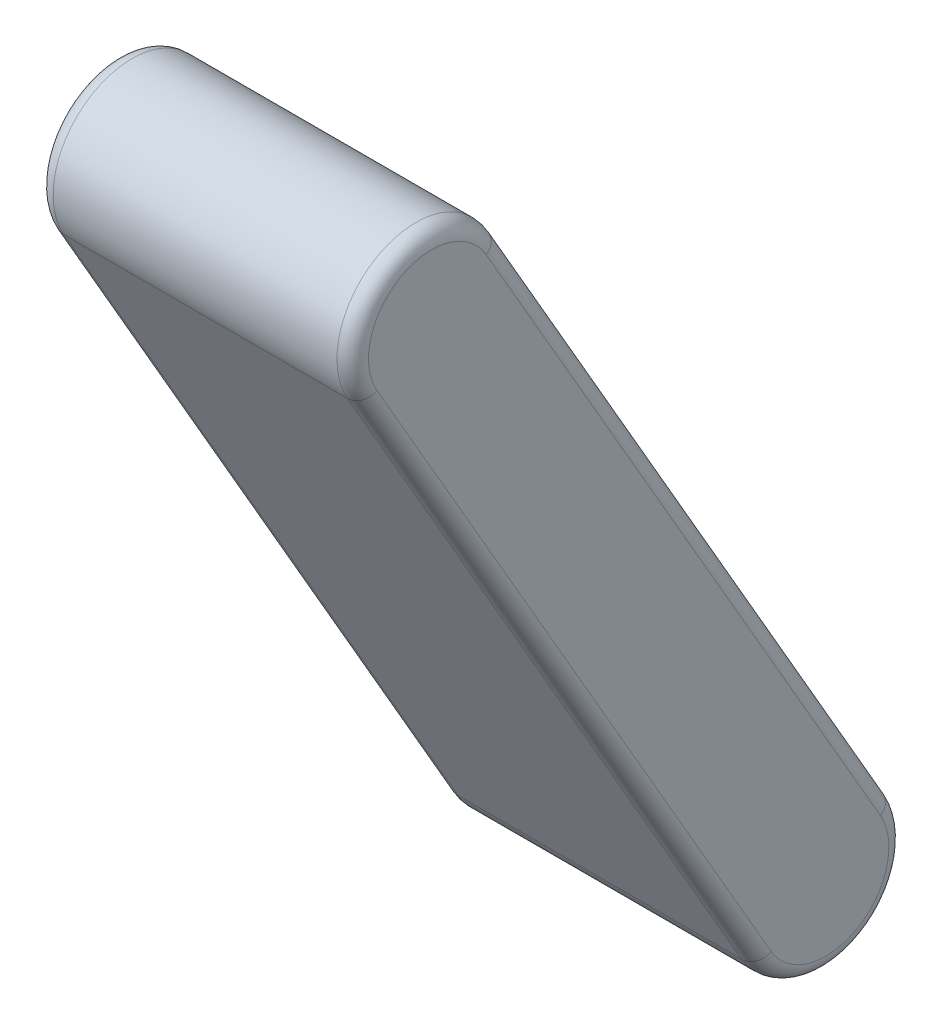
ISO-10303-21;
HEADER;
FILE_DESCRIPTION(('STEP AP214'),'2;1');
FILE_NAME('part.step','',(''),(''),'','','');
FILE_SCHEMA(('AUTOMOTIVE_DESIGN { 1 0 10303 214 1 1 1 1 }'));
ENDSEC;
DATA;
#1=APPLICATION_CONTEXT('core data for automotive mechanical design processes');
#2=APPLICATION_PROTOCOL_DEFINITION('international standard','automotive_design',2000,#1);
#3=PRODUCT_CONTEXT('',#1,'mechanical');
#4=PRODUCT('Part','Part','',(#3));
#5=PRODUCT_RELATED_PRODUCT_CATEGORY('part','',(#4));
#6=PRODUCT_DEFINITION_FORMATION('','',#4);
#7=PRODUCT_DEFINITION_CONTEXT('part definition',#1,'design');
#8=PRODUCT_DEFINITION('design','',#6,#7);
#9=PRODUCT_DEFINITION_SHAPE('','',#8);
#10=(LENGTH_UNIT() NAMED_UNIT(*) SI_UNIT(.MILLI.,.METRE.));
#11=(NAMED_UNIT(*) PLANE_ANGLE_UNIT() SI_UNIT($,.RADIAN.));
#12=(NAMED_UNIT(*) SI_UNIT($,.STERADIAN.) SOLID_ANGLE_UNIT());
#13=UNCERTAINTY_MEASURE_WITH_UNIT(LENGTH_MEASURE(1.E-05),#10,'distance_accuracy_value','');
#14=(GEOMETRIC_REPRESENTATION_CONTEXT(3) GLOBAL_UNCERTAINTY_ASSIGNED_CONTEXT((#13)) GLOBAL_UNIT_ASSIGNED_CONTEXT((#10,
#11,#12)) REPRESENTATION_CONTEXT('',''));
#15=CARTESIAN_POINT('',(0.,0.,0.));
#16=DIRECTION('',(0.,0.,1.));
#17=DIRECTION('',(1.,0.,0.));
#18=AXIS2_PLACEMENT_3D('',#15,#16,#17);
#19=CARTESIAN_POINT('',(10.,7.9999999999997,-63.8564064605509));
#20=DIRECTION('',(-1.,0.,0.));
#21=DIRECTION('',(0.,0.,1.));
#22=AXIS2_PLACEMENT_3D('',#19,#20,#21);
#23=CYLINDRICAL_SURFACE('',#22,4.99999999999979);
#24=DIRECTION('',(-1.,0.,0.));
#25=VECTOR('',#24,1.);
#26=CARTESIAN_POINT('',(10.,5.49999999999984,-59.5262794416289));
#27=LINE('',#26,#25);
#28=CARTESIAN_POINT('',(9.,5.49999999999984,-59.5262794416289));
#29=VERTEX_POINT('',#28);
#30=CARTESIAN_POINT('',(-9.,5.49999999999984,-59.5262794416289));
#31=VERTEX_POINT('',#30);
#32=EDGE_CURVE('E999',#29,#31,#27,.T.);
#33=ORIENTED_EDGE('',*,*,#32,.T.);
#34=CARTESIAN_POINT('',(-9.,7.9999999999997,-63.8564064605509));
#35=DIRECTION('',(1.,0.,0.));
#36=DIRECTION('',(0.,0.,-1.));
#37=AXIS2_PLACEMENT_3D('',#34,#35,#36);
#38=CIRCLE('',#37,4.99999999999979);
#39=CARTESIAN_POINT('',(-9.,10.4999999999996,-68.186533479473));
#40=VERTEX_POINT('',#39);
#41=EDGE_CURVE('E1015',#31,#40,#38,.T.);
#42=ORIENTED_EDGE('',*,*,#41,.T.);
#43=DIRECTION('',(-1.,0.,0.));
#44=VECTOR('',#43,1.);
#45=CARTESIAN_POINT('',(10.,10.4999999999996,-68.186533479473));
#46=LINE('',#45,#44);
#47=CARTESIAN_POINT('',(9.,10.4999999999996,-68.186533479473));
#48=VERTEX_POINT('',#47);
#49=EDGE_CURVE('E1009',#48,#40,#46,.T.);
#50=ORIENTED_EDGE('',*,*,#49,.F.);
#51=CARTESIAN_POINT('',(9.,7.9999999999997,-63.8564064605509));
#52=DIRECTION('',(1.,0.,0.));
#53=DIRECTION('',(0.,0.,-1.));
#54=AXIS2_PLACEMENT_3D('',#51,#52,#53);
#55=CIRCLE('',#54,4.99999999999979);
#56=EDGE_CURVE('E1012',#48,#29,#55,.F.);
#57=ORIENTED_EDGE('',*,*,#56,.T.);
#58=EDGE_LOOP('',(#33,#42,#50,#57));
#59=FACE_BOUND('',#58,.T.);
#60=ADVANCED_FACE('F32',(#59),#23,.T.);
#61=CARTESIAN_POINT('',(10.,10.4999999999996,-68.186533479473));
#62=DIRECTION('',(0.,-0.499999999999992,0.866025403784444));
#63=DIRECTION('',(0.,-0.866025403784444,-0.499999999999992));
#64=AXIS2_PLACEMENT_3D('',#61,#62,#63);
#65=PLANE('',#64);
#66=DIRECTION('',(-1.,0.,0.));
#67=VECTOR('',#66,1.);
#68=CARTESIAN_POINT('',(-1.56933162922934,29.8094518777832,-57.0382162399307));
#69=LINE('',#68,#67);
#70=CARTESIAN_POINT('',(1.29782228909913,29.8094518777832,-57.0382162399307));
#71=VERTEX_POINT('',#70);
#72=CARTESIAN_POINT('',(-1.56933162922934,29.8094518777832,-57.0382162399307));
#73=VERTEX_POINT('',#72);
#74=EDGE_CURVE('E559',#71,#73,#69,.T.);
#75=ORIENTED_EDGE('',*,*,#74,.F.);
#76=CARTESIAN_POINT('',(1.29782228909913,29.9547227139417,-56.9543440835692));
#77=DIRECTION('',(0.,0.499999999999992,-0.866025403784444));
#78=DIRECTION('',(0.,0.866025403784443,0.499999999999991));
#79=AXIS2_PLACEMENT_3D('',#76,#77,#78);
#80=CIRCLE('',#79,0.16774431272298);
#81=CARTESIAN_POINT('',(1.46556660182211,29.9547227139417,-56.9543440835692));
#82=VERTEX_POINT('',#81);
#83=EDGE_CURVE('E49',#82,#71,#80,.T.);
#84=ORIENTED_EDGE('',*,*,#83,.F.);
#85=DIRECTION('',(0.,-0.866025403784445,-0.49999999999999));
#86=VECTOR('',#85,1.);
#87=CARTESIAN_POINT('',(1.46556660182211,29.9547227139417,-56.9543440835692));
#88=LINE('',#87,#86);
#89=CARTESIAN_POINT('',(1.46556660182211,30.546076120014,-56.6129260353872));
#90=VERTEX_POINT('',#89);
#91=EDGE_CURVE('E503',#90,#82,#88,.T.);
#92=ORIENTED_EDGE('',*,*,#91,.F.);
#93=CARTESIAN_POINT('',(1.29782228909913,30.546076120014,-56.6129260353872));
#94=DIRECTION('',(0.,0.499999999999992,-0.866025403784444));
#95=DIRECTION('',(0.,0.866025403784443,0.499999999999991));
#96=AXIS2_PLACEMENT_3D('',#93,#94,#95);
#97=CIRCLE('',#96,0.167744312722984);
#98=CARTESIAN_POINT('',(1.29782228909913,30.6913469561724,-56.5290538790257));
#99=VERTEX_POINT('',#98);
#100=EDGE_CURVE('E506',#99,#90,#97,.T.);
#101=ORIENTED_EDGE('',*,*,#100,.F.);
#102=DIRECTION('',(1.,0.,0.));
#103=VECTOR('',#102,1.);
#104=CARTESIAN_POINT('',(1.29782228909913,30.6913469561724,-56.5290538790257));
#105=LINE('',#104,#103);
#106=CARTESIAN_POINT('',(0.541530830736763,30.6913469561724,-56.5290538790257));
#107=VERTEX_POINT('',#106);
#108=EDGE_CURVE('E606',#107,#99,#105,.T.);
#109=ORIENTED_EDGE('',*,*,#108,.F.);
#110=CARTESIAN_POINT('',(0.541530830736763,30.8366177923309,-56.4451817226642));
#111=DIRECTION('',(0.,-0.499999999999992,0.866025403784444));
#112=DIRECTION('',(0.,-0.866025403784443,-0.499999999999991));
#113=AXIS2_PLACEMENT_3D('',#110,#111,#112);
#114=CIRCLE('',#113,0.167744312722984);
#115=CARTESIAN_POINT('',(0.373786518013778,30.8366177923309,-56.4451817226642));
#116=VERTEX_POINT('',#115);
#117=EDGE_CURVE('E603',#116,#107,#114,.T.);
#118=ORIENTED_EDGE('',*,*,#117,.F.);
#119=DIRECTION('',(0.,-0.866025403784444,-0.49999999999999));
#120=VECTOR('',#119,1.);
#121=CARTESIAN_POINT('',(0.373786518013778,30.8366177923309,-56.4451817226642));
#122=LINE('',#121,#120);
#123=CARTESIAN_POINT('',(0.373786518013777,32.6890233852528,-55.3756948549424));
#124=VERTEX_POINT('',#123);
#125=EDGE_CURVE('E600',#124,#116,#122,.T.);
#126=ORIENTED_EDGE('',*,*,#125,.F.);
#127=CARTESIAN_POINT('',(0.541530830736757,32.6890233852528,-55.3756948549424));
#128=DIRECTION('',(0.,-0.499999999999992,0.866025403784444));
#129=DIRECTION('',(0.,-0.866025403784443,-0.499999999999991));
#130=AXIS2_PLACEMENT_3D('',#127,#128,#129);
#131=CIRCLE('',#130,0.167744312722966);
#132=CARTESIAN_POINT('',(0.541530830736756,32.8342942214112,-55.2918226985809));
#133=VERTEX_POINT('',#132);
#134=EDGE_CURVE('E597',#133,#124,#131,.T.);
#135=ORIENTED_EDGE('',*,*,#134,.F.);
#136=DIRECTION('',(-1.,0.,0.));
#137=VECTOR('',#136,1.);
#138=CARTESIAN_POINT('',(0.541530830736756,32.8342942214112,-55.2918226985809));
#139=LINE('',#138,#137);
#140=CARTESIAN_POINT('',(1.29782228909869,32.8342942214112,-55.2918226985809));
#141=VERTEX_POINT('',#140);
#142=EDGE_CURVE('E594',#141,#133,#139,.T.);
#143=ORIENTED_EDGE('',*,*,#142,.F.);
#144=CARTESIAN_POINT('',(1.29782228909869,32.9795650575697,-55.2079505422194));
#145=DIRECTION('',(0.,0.499999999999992,-0.866025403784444));
#146=DIRECTION('',(0.,0.866025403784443,0.499999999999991));
#147=AXIS2_PLACEMENT_3D('',#144,#145,#146);
#148=CIRCLE('',#147,0.167744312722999);
#149=CARTESIAN_POINT('',(1.46556660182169,32.9795650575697,-55.2079505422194));
#150=VERTEX_POINT('',#149);
#151=EDGE_CURVE('E591',#150,#141,#148,.T.);
#152=ORIENTED_EDGE('',*,*,#151,.F.);
#153=DIRECTION('',(0.,-0.866025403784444,-0.49999999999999));
#154=VECTOR('',#153,1.);
#155=CARTESIAN_POINT('',(1.46556660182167,32.9795650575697,-55.2079505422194));
#156=LINE('',#155,#154);
#157=CARTESIAN_POINT('',(1.46556660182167,33.5713558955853,-54.8662799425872));
#158=VERTEX_POINT('',#157);
#159=EDGE_CURVE('E588',#158,#150,#156,.T.);
#160=ORIENTED_EDGE('',*,*,#159,.F.);
#161=CARTESIAN_POINT('',(1.29782228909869,33.5713558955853,-54.8662799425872));
#162=DIRECTION('',(0.,0.499999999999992,-0.866025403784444));
#163=DIRECTION('',(0.,-0.866025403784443,-0.499999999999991));
#164=AXIS2_PLACEMENT_3D('',#161,#162,#163);
#165=CIRCLE('',#164,0.167744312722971);
#166=CARTESIAN_POINT('',(1.29782228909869,33.7166267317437,-54.7824077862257));
#167=VERTEX_POINT('',#166);
#168=EDGE_CURVE('E585',#167,#158,#165,.T.);
#169=ORIENTED_EDGE('',*,*,#168,.F.);
#170=DIRECTION('',(1.,0.,0.));
#171=VECTOR('',#170,1.);
#172=CARTESIAN_POINT('',(1.29782228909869,33.7166267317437,-54.7824077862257));
#173=LINE('',#172,#171);
#174=CARTESIAN_POINT('',(-0.477046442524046,33.7166267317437,-54.7824077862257));
#175=VERTEX_POINT('',#174);
#176=EDGE_CURVE('E582',#175,#167,#173,.T.);
#177=ORIENTED_EDGE('',*,*,#176,.F.);
#178=CARTESIAN_POINT('',(-0.477046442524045,33.5713558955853,-54.8662799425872));
#179=DIRECTION('',(0.,0.499999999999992,-0.866025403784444));
#180=DIRECTION('',(0.,0.866025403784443,0.499999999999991));
#181=AXIS2_PLACEMENT_3D('',#178,#179,#180);
#182=CIRCLE('',#181,0.167744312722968);
#183=CARTESIAN_POINT('',(-0.644790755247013,33.5713558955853,-54.8662799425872));
#184=VERTEX_POINT('',#183);
#185=EDGE_CURVE('E579',#184,#175,#182,.T.);
#186=ORIENTED_EDGE('',*,*,#185,.F.);
#187=DIRECTION('',(0.,0.866025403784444,0.499999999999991));
#188=VECTOR('',#187,1.);
#189=CARTESIAN_POINT('',(-0.644790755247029,33.5713558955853,-54.8662799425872));
#190=LINE('',#189,#188);
#191=CARTESIAN_POINT('',(-0.644790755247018,30.8366177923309,-56.4451817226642));
#192=VERTEX_POINT('',#191);
#193=EDGE_CURVE('E576',#192,#184,#190,.T.);
#194=ORIENTED_EDGE('',*,*,#193,.F.);
#195=CARTESIAN_POINT('',(-0.812535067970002,30.8366177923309,-56.4451817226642));
#196=DIRECTION('',(0.,-0.499999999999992,0.866025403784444));
#197=DIRECTION('',(0.,-0.866025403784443,-0.499999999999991));
#198=AXIS2_PLACEMENT_3D('',#195,#196,#197);
#199=CIRCLE('',#198,0.167744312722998);
#200=CARTESIAN_POINT('',(-0.81253506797,30.6913469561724,-56.5290538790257));
#201=VERTEX_POINT('',#200);
#202=EDGE_CURVE('E573',#201,#192,#199,.T.);
#203=ORIENTED_EDGE('',*,*,#202,.F.);
#204=DIRECTION('',(1.,0.,0.));
#205=VECTOR('',#204,1.);
#206=CARTESIAN_POINT('',(-0.81253506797,30.6913469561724,-56.5290538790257));
#207=LINE('',#206,#205);
#208=CARTESIAN_POINT('',(-1.56933162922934,30.6913469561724,-56.5290538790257));
#209=VERTEX_POINT('',#208);
#210=EDGE_CURVE('E570',#209,#201,#207,.T.);
#211=ORIENTED_EDGE('',*,*,#210,.F.);
#212=CARTESIAN_POINT('',(-1.56933162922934,30.5460761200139,-56.6129260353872));
#213=DIRECTION('',(0.,0.499999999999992,-0.866025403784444));
#214=DIRECTION('',(0.,0.866025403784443,0.499999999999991));
#215=AXIS2_PLACEMENT_3D('',#212,#213,#214);
#216=CIRCLE('',#215,0.16774431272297);
#217=CARTESIAN_POINT('',(-1.73707594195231,30.546076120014,-56.6129260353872));
#218=VERTEX_POINT('',#217);
#219=EDGE_CURVE('E567',#218,#209,#216,.T.);
#220=ORIENTED_EDGE('',*,*,#219,.F.);
#221=DIRECTION('',(0.,0.866025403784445,0.49999999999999));
#222=VECTOR('',#221,1.);
#223=CARTESIAN_POINT('',(-1.73707594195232,30.546076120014,-56.6129260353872));
#224=LINE('',#223,#222);
#225=CARTESIAN_POINT('',(-1.73707594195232,29.9547227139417,-56.9543440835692));
#226=VERTEX_POINT('',#225);
#227=EDGE_CURVE('E564',#226,#218,#224,.T.);
#228=ORIENTED_EDGE('',*,*,#227,.F.);
#229=CARTESIAN_POINT('',(-1.56933162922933,29.9547227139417,-56.9543440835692));
#230=DIRECTION('',(0.,0.499999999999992,-0.866025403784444));
#231=DIRECTION('',(0.,0.866025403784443,0.499999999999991));
#232=AXIS2_PLACEMENT_3D('',#229,#230,#231);
#233=CIRCLE('',#232,0.167744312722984);
#234=EDGE_CURVE('E561',#73,#226,#233,.T.);
#235=ORIENTED_EDGE('',*,*,#234,.F.);
#236=EDGE_LOOP('',(#75,#84,#92,#101,#109,#118,#126,#135,#143,#152,#160,#169,#177,#186,#194,#203,
#211,#220,#228,#235));
#237=FACE_BOUND('',#236,.T.);
#238=DIRECTION('',(-1.,0.,0.));
#239=VECTOR('',#238,1.);
#240=CARTESIAN_POINT('',(-2.19648010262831,34.7257502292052,-54.1997900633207));
#241=LINE('',#240,#239);
#242=CARTESIAN_POINT('',(-2.19648010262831,34.7257502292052,-54.1997900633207));
#243=VERTEX_POINT('',#242);
#244=CARTESIAN_POINT('',(-3.38943308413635,34.7257502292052,-54.1997900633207));
#245=VERTEX_POINT('',#244);
#246=EDGE_CURVE('E723',#243,#245,#241,.T.);
#247=ORIENTED_EDGE('',*,*,#246,.F.);
#248=CARTESIAN_POINT('',(-2.19648010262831,34.8710210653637,-54.1159179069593));
#249=DIRECTION('',(0.,0.499999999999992,-0.866025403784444));
#250=DIRECTION('',(0.,-0.866025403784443,-0.499999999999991));
#251=AXIS2_PLACEMENT_3D('',#248,#249,#250);
#252=CIRCLE('',#251,0.167744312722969);
#253=CARTESIAN_POINT('',(-2.02873578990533,34.8710210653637,-54.1159179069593));
#254=VERTEX_POINT('',#253);
#255=EDGE_CURVE('E57',#254,#243,#252,.T.);
#256=ORIENTED_EDGE('',*,*,#255,.F.);
#257=DIRECTION('',(0.,-0.866025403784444,-0.499999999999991));
#258=VECTOR('',#257,1.);
#259=CARTESIAN_POINT('',(-2.02873578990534,35.4628119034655,-53.7742473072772));
#260=LINE('',#259,#258);
#261=CARTESIAN_POINT('',(-2.02873578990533,35.4628119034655,-53.7742473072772));
#262=VERTEX_POINT('',#261);
#263=EDGE_CURVE('E652',#262,#254,#260,.T.);
#264=ORIENTED_EDGE('',*,*,#263,.F.);
#265=CARTESIAN_POINT('',(-2.19648010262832,35.4628119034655,-53.7742473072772));
#266=DIRECTION('',(0.,0.499999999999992,-0.866025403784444));
#267=DIRECTION('',(0.,-0.866025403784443,-0.499999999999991));
#268=AXIS2_PLACEMENT_3D('',#265,#266,#267);
#269=CIRCLE('',#268,0.167744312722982);
#270=CARTESIAN_POINT('',(-2.19648010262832,35.608082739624,-53.6903751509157));
#271=VERTEX_POINT('',#270);
#272=EDGE_CURVE('E786',#271,#262,#269,.T.);
#273=ORIENTED_EDGE('',*,*,#272,.F.);
#274=DIRECTION('',(1.,0.,0.));
#275=VECTOR('',#274,1.);
#276=CARTESIAN_POINT('',(-3.38943308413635,35.608082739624,-53.6903751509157));
#277=LINE('',#276,#275);
#278=CARTESIAN_POINT('',(-3.38943308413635,35.608082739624,-53.6903751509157));
#279=VERTEX_POINT('',#278);
#280=EDGE_CURVE('E783',#279,#271,#277,.T.);
#281=ORIENTED_EDGE('',*,*,#280,.F.);
#282=CARTESIAN_POINT('',(-3.38943308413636,35.7533535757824,-53.6065029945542));
#283=DIRECTION('',(0.,-0.499999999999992,0.866025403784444));
#284=DIRECTION('',(0.,0.866025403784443,0.499999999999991));
#285=AXIS2_PLACEMENT_3D('',#282,#283,#284);
#286=CIRCLE('',#285,0.167744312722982);
#287=CARTESIAN_POINT('',(-3.55717739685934,35.7533535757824,-53.6065029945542));
#288=VERTEX_POINT('',#287);
#289=EDGE_CURVE('E780',#288,#279,#286,.T.);
#290=ORIENTED_EDGE('',*,*,#289,.F.);
#291=DIRECTION('',(0.,-0.866025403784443,-0.499999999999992));
#292=VECTOR('',#291,1.);
#293=CARTESIAN_POINT('',(-3.55717739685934,36.786481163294,-53.0100265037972));
#294=LINE('',#293,#292);
#295=CARTESIAN_POINT('',(-3.55717739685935,36.786481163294,-53.0100265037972));
#296=VERTEX_POINT('',#295);
#297=EDGE_CURVE('E777',#296,#288,#294,.T.);
#298=ORIENTED_EDGE('',*,*,#297,.F.);
#299=CARTESIAN_POINT('',(-3.72492170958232,36.786481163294,-53.0100265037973));
#300=DIRECTION('',(0.,0.499999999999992,-0.866025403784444));
#301=DIRECTION('',(0.,-0.866025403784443,-0.499999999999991));
#302=AXIS2_PLACEMENT_3D('',#299,#300,#301);
#303=CIRCLE('',#302,0.167744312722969);
#304=CARTESIAN_POINT('',(-3.72492170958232,36.9317519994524,-52.9261543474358));
#305=VERTEX_POINT('',#304);
#306=EDGE_CURVE('E774',#305,#296,#303,.T.);
#307=ORIENTED_EDGE('',*,*,#306,.F.);
#308=DIRECTION('',(1.,0.,0.));
#309=VECTOR('',#308,1.);
#310=CARTESIAN_POINT('',(-4.40826290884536,36.9317519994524,-52.9261543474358));
#311=LINE('',#310,#309);
#312=CARTESIAN_POINT('',(-4.40826290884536,36.9317519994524,-52.9261543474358));
#313=VERTEX_POINT('',#312);
#314=EDGE_CURVE('E771',#313,#305,#311,.T.);
#315=ORIENTED_EDGE('',*,*,#314,.F.);
#316=CARTESIAN_POINT('',(-4.40826290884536,36.786481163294,-53.0100265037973));
#317=DIRECTION('',(0.,0.499999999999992,-0.866025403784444));
#318=DIRECTION('',(0.,0.866025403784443,0.499999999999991));
#319=AXIS2_PLACEMENT_3D('',#316,#317,#318);
#320=CIRCLE('',#319,0.167744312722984);
#321=CARTESIAN_POINT('',(-4.57600722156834,36.786481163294,-53.0100265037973));
#322=VERTEX_POINT('',#321);
#323=EDGE_CURVE('E768',#322,#313,#320,.T.);
#324=ORIENTED_EDGE('',*,*,#323,.F.);
#325=DIRECTION('',(0.,0.866025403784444,0.49999999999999));
#326=VECTOR('',#325,1.);
#327=CARTESIAN_POINT('',(-4.57600722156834,35.7533535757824,-53.6065029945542));
#328=LINE('',#327,#326);
#329=CARTESIAN_POINT('',(-4.57600722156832,35.7533535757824,-53.6065029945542));
#330=VERTEX_POINT('',#329);
#331=EDGE_CURVE('E765',#330,#322,#328,.T.);
#332=ORIENTED_EDGE('',*,*,#331,.F.);
#333=CARTESIAN_POINT('',(-4.74375153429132,35.7533535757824,-53.6065029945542));
#334=DIRECTION('',(0.,-0.499999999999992,0.866025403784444));
#335=DIRECTION('',(0.,0.866025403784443,0.499999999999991));
#336=AXIS2_PLACEMENT_3D('',#333,#334,#335);
#337=CIRCLE('',#336,0.167744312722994);
#338=CARTESIAN_POINT('',(-4.74375153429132,35.608082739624,-53.6903751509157));
#339=VERTEX_POINT('',#338);
#340=EDGE_CURVE('E762',#339,#330,#337,.T.);
#341=ORIENTED_EDGE('',*,*,#340,.F.);
#342=DIRECTION('',(1.,0.,0.));
#343=VECTOR('',#342,1.);
#344=CARTESIAN_POINT('',(-5.93670451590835,35.608082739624,-53.6903751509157));
#345=LINE('',#344,#343);
#346=CARTESIAN_POINT('',(-5.93670451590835,35.608082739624,-53.6903751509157));
#347=VERTEX_POINT('',#346);
#348=EDGE_CURVE('E759',#347,#339,#345,.T.);
#349=ORIENTED_EDGE('',*,*,#348,.F.);
#350=CARTESIAN_POINT('',(-5.93670451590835,35.4628119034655,-53.7742473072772));
#351=DIRECTION('',(0.,0.499999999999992,-0.866025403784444));
#352=DIRECTION('',(0.,-0.866025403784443,-0.499999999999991));
#353=AXIS2_PLACEMENT_3D('',#350,#351,#352);
#354=CIRCLE('',#353,0.167744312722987);
#355=CARTESIAN_POINT('',(-6.10444882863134,35.4628119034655,-53.7742473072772));
#356=VERTEX_POINT('',#355);
#357=EDGE_CURVE('E756',#356,#347,#354,.T.);
#358=ORIENTED_EDGE('',*,*,#357,.F.);
#359=DIRECTION('',(0.,0.866025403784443,0.499999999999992));
#360=VECTOR('',#359,1.);
#361=CARTESIAN_POINT('',(-6.10444882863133,34.8710210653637,-54.1159179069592));
#362=LINE('',#361,#360);
#363=CARTESIAN_POINT('',(-6.10444882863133,34.8710210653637,-54.1159179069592));
#364=VERTEX_POINT('',#363);
#365=EDGE_CURVE('E753',#364,#356,#362,.T.);
#366=ORIENTED_EDGE('',*,*,#365,.F.);
#367=CARTESIAN_POINT('',(-5.93670451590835,34.8710210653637,-54.1159179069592));
#368=DIRECTION('',(0.,0.499999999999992,-0.866025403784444));
#369=DIRECTION('',(0.,-0.866025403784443,-0.499999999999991));
#370=AXIS2_PLACEMENT_3D('',#367,#368,#369);
#371=CIRCLE('',#370,0.167744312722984);
#372=CARTESIAN_POINT('',(-5.93670451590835,34.7257502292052,-54.1997900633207));
#373=VERTEX_POINT('',#372);
#374=EDGE_CURVE('E750',#373,#364,#371,.T.);
#375=ORIENTED_EDGE('',*,*,#374,.F.);
#376=DIRECTION('',(-1.,0.,0.));
#377=VECTOR('',#376,1.);
#378=CARTESIAN_POINT('',(-4.74375153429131,34.7257502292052,-54.1997900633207));
#379=LINE('',#378,#377);
#380=CARTESIAN_POINT('',(-4.74375153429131,34.7257502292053,-54.1997900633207));
#381=VERTEX_POINT('',#380);
#382=EDGE_CURVE('E747',#381,#373,#379,.T.);
#383=ORIENTED_EDGE('',*,*,#382,.F.);
#384=CARTESIAN_POINT('',(-4.74375153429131,34.5804793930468,-54.2836622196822));
#385=DIRECTION('',(0.,-0.499999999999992,0.866025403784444));
#386=DIRECTION('',(0.,0.866025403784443,0.499999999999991));
#387=AXIS2_PLACEMENT_3D('',#384,#385,#386);
#388=CIRCLE('',#387,0.167744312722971);
#389=CARTESIAN_POINT('',(-4.57600722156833,34.5804793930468,-54.2836622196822));
#390=VERTEX_POINT('',#389);
#391=EDGE_CURVE('E744',#390,#381,#388,.T.);
#392=ORIENTED_EDGE('',*,*,#391,.F.);
#393=DIRECTION('',(0.,0.866025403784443,0.499999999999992));
#394=VECTOR('',#393,1.);
#395=CARTESIAN_POINT('',(-4.57600722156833,33.5473518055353,-54.8801387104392));
#396=LINE('',#395,#394);
#397=CARTESIAN_POINT('',(-4.57600722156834,33.5473518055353,-54.8801387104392));
#398=VERTEX_POINT('',#397);
#399=EDGE_CURVE('E741',#398,#390,#396,.T.);
#400=ORIENTED_EDGE('',*,*,#399,.F.);
#401=CARTESIAN_POINT('',(-4.40826290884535,33.5473518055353,-54.8801387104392));
#402=DIRECTION('',(0.,0.499999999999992,-0.866025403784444));
#403=DIRECTION('',(0.,-0.866025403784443,-0.499999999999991));
#404=AXIS2_PLACEMENT_3D('',#401,#402,#403);
#405=CIRCLE('',#404,0.167744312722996);
#406=CARTESIAN_POINT('',(-4.40826290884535,33.4020809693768,-54.9640108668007));
#407=VERTEX_POINT('',#406);
#408=EDGE_CURVE('E738',#407,#398,#405,.T.);
#409=ORIENTED_EDGE('',*,*,#408,.F.);
#410=DIRECTION('',(-1.,0.,0.));
#411=VECTOR('',#410,1.);
#412=CARTESIAN_POINT('',(-3.72492170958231,33.4020809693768,-54.9640108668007));
#413=LINE('',#412,#411);
#414=CARTESIAN_POINT('',(-3.72492170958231,33.4020809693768,-54.9640108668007));
#415=VERTEX_POINT('',#414);
#416=EDGE_CURVE('E735',#415,#407,#413,.T.);
#417=ORIENTED_EDGE('',*,*,#416,.F.);
#418=CARTESIAN_POINT('',(-3.72492170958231,33.5473518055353,-54.8801387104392));
#419=DIRECTION('',(0.,0.499999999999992,-0.866025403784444));
#420=DIRECTION('',(0.,-0.866025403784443,-0.499999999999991));
#421=AXIS2_PLACEMENT_3D('',#418,#419,#420);
#422=CIRCLE('',#421,0.167744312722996);
#423=CARTESIAN_POINT('',(-3.55717739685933,33.5473518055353,-54.8801387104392));
#424=VERTEX_POINT('',#423);
#425=EDGE_CURVE('E732',#424,#415,#422,.T.);
#426=ORIENTED_EDGE('',*,*,#425,.F.);
#427=DIRECTION('',(0.,-0.866025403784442,-0.499999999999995));
#428=VECTOR('',#427,1.);
#429=CARTESIAN_POINT('',(-3.55717739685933,34.5804793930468,-54.2836622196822));
#430=LINE('',#429,#428);
#431=CARTESIAN_POINT('',(-3.55717739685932,34.5804793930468,-54.2836622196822));
#432=VERTEX_POINT('',#431);
#433=EDGE_CURVE('E729',#432,#424,#430,.T.);
#434=ORIENTED_EDGE('',*,*,#433,.F.);
#435=CARTESIAN_POINT('',(-3.38943308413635,34.5804793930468,-54.2836622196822));
#436=DIRECTION('',(0.,-0.499999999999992,0.866025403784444));
#437=DIRECTION('',(0.,0.866025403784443,0.499999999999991));
#438=AXIS2_PLACEMENT_3D('',#435,#436,#437);
#439=CIRCLE('',#438,0.167744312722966);
#440=EDGE_CURVE('E726',#245,#432,#439,.T.);
#441=ORIENTED_EDGE('',*,*,#440,.F.);
#442=EDGE_LOOP('',(#247,#256,#264,#273,#281,#290,#298,#307,#315,#324,#332,#341,#349,#358,#366,
#375,#383,#392,#400,#409,#417,#426,#434,#441));
#443=FACE_BOUND('',#442,.T.);
#444=DIRECTION('',(-1.,0.,0.));
#445=VECTOR('',#444,1.);
#446=CARTESIAN_POINT('',(-4.40826290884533,27.9179958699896,-58.1302488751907));
#447=LINE('',#446,#445);
#448=CARTESIAN_POINT('',(4.1362484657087,27.9179958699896,-58.1302488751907));
#449=VERTEX_POINT('',#448);
#450=CARTESIAN_POINT('',(-4.40826290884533,27.9179958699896,-58.1302488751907));
#451=VERTEX_POINT('',#450);
#452=EDGE_CURVE('E902',#449,#451,#447,.T.);
#453=ORIENTED_EDGE('',*,*,#452,.F.);
#454=CARTESIAN_POINT('',(4.1362484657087,28.063266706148,-58.0463767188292));
#455=DIRECTION('',(0.,0.499999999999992,-0.866025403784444));
#456=DIRECTION('',(0.,-0.866025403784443,-0.499999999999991));
#457=AXIS2_PLACEMENT_3D('',#454,#455,#456);
#458=CIRCLE('',#457,0.167744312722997);
#459=CARTESIAN_POINT('',(4.30399277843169,28.063266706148,-58.0463767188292));
#460=VERTEX_POINT('',#459);
#461=EDGE_CURVE('E793',#460,#449,#458,.T.);
#462=ORIENTED_EDGE('',*,*,#461,.F.);
#463=DIRECTION('',(0.,-0.866025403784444,-0.499999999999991));
#464=VECTOR('',#463,1.);
#465=CARTESIAN_POINT('',(4.30399277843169,28.063266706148,-58.0463767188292));
#466=LINE('',#465,#464);
#467=CARTESIAN_POINT('',(4.30399277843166,35.4628119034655,-53.7742473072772));
#468=VERTEX_POINT('',#467);
#469=EDGE_CURVE('E843',#468,#460,#466,.T.);
#470=ORIENTED_EDGE('',*,*,#469,.F.);
#471=CARTESIAN_POINT('',(4.13624846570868,35.4628119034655,-53.7742473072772));
#472=DIRECTION('',(0.,0.499999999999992,-0.866025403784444));
#473=DIRECTION('',(0.,-0.866025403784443,-0.499999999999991));
#474=AXIS2_PLACEMENT_3D('',#471,#472,#473);
#475=CIRCLE('',#474,0.167744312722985);
#476=CARTESIAN_POINT('',(4.13624846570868,35.608082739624,-53.6903751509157));
#477=VERTEX_POINT('',#476);
#478=EDGE_CURVE('E953',#477,#468,#475,.T.);
#479=ORIENTED_EDGE('',*,*,#478,.F.);
#480=DIRECTION('',(1.,0.,0.));
#481=VECTOR('',#480,1.);
#482=CARTESIAN_POINT('',(4.13624846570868,35.608082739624,-53.6903751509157));
#483=LINE('',#482,#481);
#484=CARTESIAN_POINT('',(-0.914465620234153,35.608082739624,-53.6903751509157));
#485=VERTEX_POINT('',#484);
#486=EDGE_CURVE('E950',#485,#477,#483,.T.);
#487=ORIENTED_EDGE('',*,*,#486,.F.);
#488=CARTESIAN_POINT('',(-0.914465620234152,35.4628119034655,-53.7742473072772));
#489=DIRECTION('',(0.,0.499999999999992,-0.866025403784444));
#490=DIRECTION('',(0.,0.866025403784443,0.499999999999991));
#491=AXIS2_PLACEMENT_3D('',#488,#489,#490);
#492=CIRCLE('',#491,0.167744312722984);
#493=CARTESIAN_POINT('',(-1.08220993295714,35.4628119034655,-53.7742473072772));
#494=VERTEX_POINT('',#493);
#495=EDGE_CURVE('E947',#494,#485,#492,.T.);
#496=ORIENTED_EDGE('',*,*,#495,.F.);
#497=DIRECTION('',(0.,0.866025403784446,0.499999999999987));
#498=VECTOR('',#497,1.);
#499=CARTESIAN_POINT('',(-1.08220993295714,35.4628119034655,-53.7742473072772));
#500=LINE('',#499,#498);
#501=CARTESIAN_POINT('',(-1.08220993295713,34.8710210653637,-54.1159179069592));
#502=VERTEX_POINT('',#501);
#503=EDGE_CURVE('E944',#502,#494,#500,.T.);
#504=ORIENTED_EDGE('',*,*,#503,.F.);
#505=CARTESIAN_POINT('',(-0.91446562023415,34.8710210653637,-54.1159179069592));
#506=DIRECTION('',(0.,0.499999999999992,-0.866025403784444));
#507=DIRECTION('',(0.,0.866025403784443,0.499999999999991));
#508=AXIS2_PLACEMENT_3D('',#505,#506,#507);
#509=CIRCLE('',#508,0.167744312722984);
#510=CARTESIAN_POINT('',(-0.914465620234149,34.7257502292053,-54.1997900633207));
#511=VERTEX_POINT('',#510);
#512=EDGE_CURVE('E941',#511,#502,#509,.T.);
#513=ORIENTED_EDGE('',*,*,#512,.F.);
#514=DIRECTION('',(-1.,0.,0.));
#515=VECTOR('',#514,1.);
#516=CARTESIAN_POINT('',(-0.914465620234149,34.7257502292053,-54.1997900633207));
#517=LINE('',#516,#515);
#518=CARTESIAN_POINT('',(3.11767119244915,34.7257502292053,-54.1997900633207));
#519=VERTEX_POINT('',#518);
#520=EDGE_CURVE('E938',#519,#511,#517,.T.);
#521=ORIENTED_EDGE('',*,*,#520,.F.);
#522=CARTESIAN_POINT('',(3.11767119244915,34.5804793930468,-54.2836622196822));
#523=DIRECTION('',(0.,-0.499999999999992,0.866025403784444));
#524=DIRECTION('',(0.,-0.866025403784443,-0.499999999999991));
#525=AXIS2_PLACEMENT_3D('',#522,#523,#524);
#526=CIRCLE('',#525,0.167744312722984);
#527=CARTESIAN_POINT('',(3.28541550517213,34.5804793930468,-54.2836622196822));
#528=VERTEX_POINT('',#527);
#529=EDGE_CURVE('E935',#528,#519,#526,.T.);
#530=ORIENTED_EDGE('',*,*,#529,.F.);
#531=DIRECTION('',(0.,0.866025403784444,0.499999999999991));
#532=VECTOR('',#531,1.);
#533=CARTESIAN_POINT('',(3.28541550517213,34.5804793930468,-54.2836622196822));
#534=LINE('',#533,#532);
#535=CARTESIAN_POINT('',(3.28541550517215,28.9455992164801,-57.5369618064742));
#536=VERTEX_POINT('',#535);
#537=EDGE_CURVE('E932',#536,#528,#534,.T.);
#538=ORIENTED_EDGE('',*,*,#537,.F.);
#539=CARTESIAN_POINT('',(3.11767119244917,28.9455992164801,-57.5369618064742));
#540=DIRECTION('',(0.,-0.499999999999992,0.866025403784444));
#541=DIRECTION('',(0.,-0.866025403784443,-0.499999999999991));
#542=AXIS2_PLACEMENT_3D('',#539,#540,#541);
#543=CIRCLE('',#542,0.167744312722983);
#544=CARTESIAN_POINT('',(3.11767119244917,28.8003283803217,-57.6208339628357));
#545=VERTEX_POINT('',#544);
#546=EDGE_CURVE('E929',#545,#536,#543,.T.);
#547=ORIENTED_EDGE('',*,*,#546,.F.);
#548=DIRECTION('',(1.,0.,0.));
#549=VECTOR('',#548,1.);
#550=CARTESIAN_POINT('',(3.11767119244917,28.8003283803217,-57.6208339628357));
#551=LINE('',#550,#549);
#552=CARTESIAN_POINT('',(-3.38943308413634,28.8003283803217,-57.6208339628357));
#553=VERTEX_POINT('',#552);
#554=EDGE_CURVE('E926',#553,#545,#551,.T.);
#555=ORIENTED_EDGE('',*,*,#554,.F.);
#556=CARTESIAN_POINT('',(-3.38943308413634,28.9455992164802,-57.5369618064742));
#557=DIRECTION('',(0.,-0.499999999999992,0.866025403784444));
#558=DIRECTION('',(0.,-0.866025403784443,-0.499999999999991));
#559=AXIS2_PLACEMENT_3D('',#556,#557,#558);
#560=CIRCLE('',#559,0.167744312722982);
#561=CARTESIAN_POINT('',(-3.55717739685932,28.9455992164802,-57.5369618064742));
#562=VERTEX_POINT('',#561);
#563=EDGE_CURVE('E923',#562,#553,#560,.T.);
#564=ORIENTED_EDGE('',*,*,#563,.F.);
#565=DIRECTION('',(0.,-0.866025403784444,-0.499999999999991));
#566=VECTOR('',#565,1.);
#567=CARTESIAN_POINT('',(-3.55717739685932,28.9455992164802,-57.5369618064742));
#568=LINE('',#567,#566);
#569=CARTESIAN_POINT('',(-3.55717739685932,32.437532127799,-55.5208934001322));
#570=VERTEX_POINT('',#569);
#571=EDGE_CURVE('E920',#570,#562,#568,.T.);
#572=ORIENTED_EDGE('',*,*,#571,.F.);
#573=CARTESIAN_POINT('',(-3.72492170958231,32.437532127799,-55.5208934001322));
#574=DIRECTION('',(0.,0.499999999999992,-0.866025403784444));
#575=DIRECTION('',(0.,0.866025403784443,0.499999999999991));
#576=AXIS2_PLACEMENT_3D('',#573,#574,#575);
#577=CIRCLE('',#576,0.167744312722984);
#578=CARTESIAN_POINT('',(-3.72492170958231,32.5828029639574,-55.4370212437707));
#579=VERTEX_POINT('',#578);
#580=EDGE_CURVE('E917',#579,#570,#577,.T.);
#581=ORIENTED_EDGE('',*,*,#580,.F.);
#582=DIRECTION('',(1.,0.,0.));
#583=VECTOR('',#582,1.);
#584=CARTESIAN_POINT('',(-3.72492170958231,32.5828029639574,-55.4370212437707));
#585=LINE('',#584,#583);
#586=CARTESIAN_POINT('',(-4.40826290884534,32.5828029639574,-55.4370212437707));
#587=VERTEX_POINT('',#586);
#588=EDGE_CURVE('E914',#587,#579,#585,.T.);
#589=ORIENTED_EDGE('',*,*,#588,.F.);
#590=CARTESIAN_POINT('',(-4.40826290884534,32.437532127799,-55.5208934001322));
#591=DIRECTION('',(0.,0.499999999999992,-0.866025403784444));
#592=DIRECTION('',(0.,-0.866025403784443,-0.499999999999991));
#593=AXIS2_PLACEMENT_3D('',#590,#591,#592);
#594=CIRCLE('',#593,0.167744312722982);
#595=CARTESIAN_POINT('',(-4.57600722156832,32.437532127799,-55.5208934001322));
#596=VERTEX_POINT('',#595);
#597=EDGE_CURVE('E911',#596,#587,#594,.T.);
#598=ORIENTED_EDGE('',*,*,#597,.F.);
#599=DIRECTION('',(0.,0.866025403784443,0.499999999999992));
#600=VECTOR('',#599,1.);
#601=CARTESIAN_POINT('',(-4.57600722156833,32.437532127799,-55.5208934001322));
#602=LINE('',#601,#600);
#603=CARTESIAN_POINT('',(-4.57600722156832,28.063266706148,-58.0463767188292));
#604=VERTEX_POINT('',#603);
#605=EDGE_CURVE('E908',#604,#596,#602,.T.);
#606=ORIENTED_EDGE('',*,*,#605,.F.);
#607=CARTESIAN_POINT('',(-4.40826290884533,28.063266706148,-58.0463767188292));
#608=DIRECTION('',(0.,0.499999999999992,-0.866025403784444));
#609=DIRECTION('',(0.,0.866025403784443,0.499999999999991));
#610=AXIS2_PLACEMENT_3D('',#607,#608,#609);
#611=CIRCLE('',#610,0.167744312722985);
#612=EDGE_CURVE('E905',#451,#604,#611,.T.);
#613=ORIENTED_EDGE('',*,*,#612,.F.);
#614=EDGE_LOOP('',(#453,#462,#470,#479,#487,#496,#504,#513,#521,#530,#538,#547,#555,#564,#572,
#581,#589,#598,#606,#613));
#615=FACE_BOUND('',#614,.T.);
#616=ORIENTED_EDGE('',*,*,#49,.T.);
#617=DIRECTION('',(0.,0.866025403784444,0.499999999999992));
#618=VECTOR('',#617,1.);
#619=CARTESIAN_POINT('',(-9.,10.4999999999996,-68.186533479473));
#620=LINE('',#619,#618);
#621=CARTESIAN_POINT('',(-9.,53.8012701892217,-43.1865334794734));
#622=VERTEX_POINT('',#621);
#623=EDGE_CURVE('E11',#40,#622,#620,.T.);
#624=ORIENTED_EDGE('',*,*,#623,.T.);
#625=DIRECTION('',(-1.,0.,0.));
#626=VECTOR('',#625,1.);
#627=CARTESIAN_POINT('',(10.,53.8012701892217,-43.1865334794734));
#628=LINE('',#627,#626);
#629=CARTESIAN_POINT('',(9.,53.8012701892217,-43.1865334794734));
#630=VERTEX_POINT('',#629);
#631=EDGE_CURVE('E1006',#630,#622,#628,.T.);
#632=ORIENTED_EDGE('',*,*,#631,.F.);
#633=DIRECTION('',(0.,0.866025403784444,0.499999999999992));
#634=VECTOR('',#633,1.);
#635=CARTESIAN_POINT('',(9.,10.4999999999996,-68.186533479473));
#636=LINE('',#635,#634);
#637=EDGE_CURVE('E41',#630,#48,#636,.F.);
#638=ORIENTED_EDGE('',*,*,#637,.T.);
#639=EDGE_LOOP('',(#616,#624,#632,#638));
#640=FACE_BOUND('',#639,.T.);
#641=ADVANCED_FACE('F1078',(#237,#443,#615,#640),#65,.F.);
#642=CARTESIAN_POINT('',(10.,51.3012701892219,-38.8564064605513));
#643=DIRECTION('',(-1.,0.,0.));
#644=DIRECTION('',(0.,0.,1.));
#645=AXIS2_PLACEMENT_3D('',#642,#643,#644);
#646=CYLINDRICAL_SURFACE('',#645,4.9999999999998);
#647=ORIENTED_EDGE('',*,*,#631,.T.);
#648=CARTESIAN_POINT('',(-9.,51.3012701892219,-38.8564064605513));
#649=DIRECTION('',(1.,0.,0.));
#650=DIRECTION('',(0.,0.,-1.));
#651=AXIS2_PLACEMENT_3D('',#648,#649,#650);
#652=CIRCLE('',#651,4.9999999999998);
#653=CARTESIAN_POINT('',(-9.,48.801270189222,-34.5262794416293));
#654=VERTEX_POINT('',#653);
#655=EDGE_CURVE('E1033',#622,#654,#652,.T.);
#656=ORIENTED_EDGE('',*,*,#655,.T.);
#657=DIRECTION('',(-1.,0.,0.));
#658=VECTOR('',#657,1.);
#659=CARTESIAN_POINT('',(10.,48.801270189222,-34.5262794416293));
#660=LINE('',#659,#658);
#661=CARTESIAN_POINT('',(9.,48.801270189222,-34.5262794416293));
#662=VERTEX_POINT('',#661);
#663=EDGE_CURVE('E1002',#662,#654,#660,.T.);
#664=ORIENTED_EDGE('',*,*,#663,.F.);
#665=CARTESIAN_POINT('',(9.,51.3012701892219,-38.8564064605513));
#666=DIRECTION('',(1.,0.,0.));
#667=DIRECTION('',(0.,0.,-1.));
#668=AXIS2_PLACEMENT_3D('',#665,#666,#667);
#669=CIRCLE('',#668,4.9999999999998);
#670=EDGE_CURVE('E1031',#662,#630,#669,.F.);
#671=ORIENTED_EDGE('',*,*,#670,.T.);
#672=EDGE_LOOP('',(#647,#656,#664,#671));
#673=FACE_BOUND('',#672,.T.);
#674=ADVANCED_FACE('F1075',(#673),#646,.T.);
#675=CARTESIAN_POINT('',(10.,48.801270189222,-34.5262794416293));
#676=DIRECTION('',(0.,0.499999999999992,-0.866025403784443));
#677=DIRECTION('',(0.,0.866025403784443,0.499999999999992));
#678=AXIS2_PLACEMENT_3D('',#675,#676,#677);
#679=PLANE('',#678);
#680=ORIENTED_EDGE('',*,*,#663,.T.);
#681=DIRECTION('',(0.,-0.866025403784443,-0.499999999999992));
#682=VECTOR('',#681,1.);
#683=CARTESIAN_POINT('',(-9.,48.801270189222,-34.5262794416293));
#684=LINE('',#683,#682);
#685=EDGE_CURVE('E1029',#654,#31,#684,.T.);
#686=ORIENTED_EDGE('',*,*,#685,.T.);
#687=ORIENTED_EDGE('',*,*,#32,.F.);
#688=DIRECTION('',(0.,-0.866025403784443,-0.499999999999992));
#689=VECTOR('',#688,1.);
#690=CARTESIAN_POINT('',(9.,48.801270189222,-34.5262794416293));
#691=LINE('',#690,#689);
#692=EDGE_CURVE('E1027',#29,#662,#691,.F.);
#693=ORIENTED_EDGE('',*,*,#692,.T.);
#694=EDGE_LOOP('',(#680,#686,#687,#693));
#695=FACE_BOUND('',#694,.T.);
#696=ADVANCED_FACE('F1103',(#695),#679,.F.);
#697=CARTESIAN_POINT('',(10.,7.9999999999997,-63.8564064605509));
#698=DIRECTION('',(1.,0.,0.));
#699=DIRECTION('',(0.,0.,-1.));
#700=AXIS2_PLACEMENT_3D('',#697,#698,#699);
#701=PLANE('',#700);
#702=DIRECTION('',(0.,-0.866025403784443,-0.499999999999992));
#703=VECTOR('',#702,1.);
#704=CARTESIAN_POINT('',(10.,5.99999999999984,-60.3923048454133));
#705=LINE('',#704,#703);
#706=CARTESIAN_POINT('',(10.,49.301270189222,-35.3923048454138));
#707=VERTEX_POINT('',#706);
#708=CARTESIAN_POINT('',(10.,5.99999999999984,-60.3923048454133));
#709=VERTEX_POINT('',#708);
#710=EDGE_CURVE('E1039',#707,#709,#705,.T.);
#711=ORIENTED_EDGE('',*,*,#710,.T.);
#712=CARTESIAN_POINT('',(10.,7.9999999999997,-63.8564064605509));
#713=DIRECTION('',(1.,0.,0.));
#714=DIRECTION('',(0.,0.,-1.));
#715=AXIS2_PLACEMENT_3D('',#712,#713,#714);
#716=CIRCLE('',#715,3.99999999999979);
#717=CARTESIAN_POINT('',(10.,9.99999999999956,-67.3205080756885));
#718=VERTEX_POINT('',#717);
#719=EDGE_CURVE('E1041',#709,#718,#716,.T.);
#720=ORIENTED_EDGE('',*,*,#719,.T.);
#721=DIRECTION('',(0.,0.866025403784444,0.499999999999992));
#722=VECTOR('',#721,1.);
#723=CARTESIAN_POINT('',(10.,53.3012701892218,-42.3205080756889));
#724=LINE('',#723,#722);
#725=CARTESIAN_POINT('',(10.,53.3012701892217,-42.3205080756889));
#726=VERTEX_POINT('',#725);
#727=EDGE_CURVE('E1035',#718,#726,#724,.T.);
#728=ORIENTED_EDGE('',*,*,#727,.T.);
#729=CARTESIAN_POINT('',(10.,51.3012701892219,-38.8564064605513));
#730=DIRECTION('',(1.,0.,0.));
#731=DIRECTION('',(0.,0.,-1.));
#732=AXIS2_PLACEMENT_3D('',#729,#730,#731);
#733=CIRCLE('',#732,3.9999999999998);
#734=EDGE_CURVE('E1037',#726,#707,#733,.T.);
#735=ORIENTED_EDGE('',*,*,#734,.T.);
#736=EDGE_LOOP('',(#711,#720,#728,#735));
#737=FACE_BOUND('',#736,.T.);
#738=ADVANCED_FACE('F1149',(#737),#701,.T.);
#739=CARTESIAN_POINT('',(-10.,7.9999999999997,-63.8564064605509));
#740=DIRECTION('',(1.,0.,0.));
#741=DIRECTION('',(0.,0.,-1.));
#742=AXIS2_PLACEMENT_3D('',#739,#740,#741);
#743=PLANE('',#742);
#744=DIRECTION('',(0.,0.866025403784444,0.499999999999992));
#745=VECTOR('',#744,1.);
#746=CARTESIAN_POINT('',(-10.,9.99999999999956,-67.3205080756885));
#747=LINE('',#746,#745);
#748=CARTESIAN_POINT('',(-10.,53.3012701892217,-42.3205080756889));
#749=VERTEX_POINT('',#748);
#750=CARTESIAN_POINT('',(-10.,9.99999999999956,-67.3205080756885));
#751=VERTEX_POINT('',#750);
#752=EDGE_CURVE('E1018',#749,#751,#747,.F.);
#753=ORIENTED_EDGE('',*,*,#752,.T.);
#754=CARTESIAN_POINT('',(-10.,7.9999999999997,-63.8564064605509));
#755=DIRECTION('',(1.,0.,0.));
#756=DIRECTION('',(0.,0.,-1.));
#757=AXIS2_PLACEMENT_3D('',#754,#755,#756);
#758=CIRCLE('',#757,3.99999999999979);
#759=CARTESIAN_POINT('',(-10.,5.99999999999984,-60.3923048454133));
#760=VERTEX_POINT('',#759);
#761=EDGE_CURVE('E1024',#751,#760,#758,.F.);
#762=ORIENTED_EDGE('',*,*,#761,.T.);
#763=DIRECTION('',(0.,-0.866025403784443,-0.499999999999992));
#764=VECTOR('',#763,1.);
#765=CARTESIAN_POINT('',(-10.,5.99999999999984,-60.3923048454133));
#766=LINE('',#765,#764);
#767=CARTESIAN_POINT('',(-10.,49.301270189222,-35.3923048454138));
#768=VERTEX_POINT('',#767);
#769=EDGE_CURVE('E1022',#760,#768,#766,.F.);
#770=ORIENTED_EDGE('',*,*,#769,.T.);
#771=CARTESIAN_POINT('',(-10.,51.3012701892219,-38.8564064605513));
#772=DIRECTION('',(1.,0.,0.));
#773=DIRECTION('',(0.,0.,-1.));
#774=AXIS2_PLACEMENT_3D('',#771,#772,#773);
#775=CIRCLE('',#774,3.9999999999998);
#776=EDGE_CURVE('E1020',#768,#749,#775,.F.);
#777=ORIENTED_EDGE('',*,*,#776,.T.);
#778=EDGE_LOOP('',(#753,#762,#770,#777));
#779=FACE_BOUND('',#778,.T.);
#780=ADVANCED_FACE('F1096',(#779),#743,.F.);
#781=CARTESIAN_POINT('',(-9.,51.3012701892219,-38.8564064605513));
#782=DIRECTION('',(1.,0.,0.));
#783=DIRECTION('',(0.,0.,-1.));
#784=AXIS2_PLACEMENT_3D('',#781,#782,#783);
#785=TOROIDAL_SURFACE('',#784,3.9999999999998,1.);
#786=CARTESIAN_POINT('',(-9.,53.3012701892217,-42.3205080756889));
#787=DIRECTION('',(0.,-0.866025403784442,-0.499999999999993));
#788=DIRECTION('',(0.,0.499999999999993,-0.866025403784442));
#789=AXIS2_PLACEMENT_3D('',#786,#787,#788);
#790=CIRCLE('',#789,1.);
#791=EDGE_CURVE('E1049',#749,#622,#790,.T.);
#792=ORIENTED_EDGE('',*,*,#791,.F.);
#793=ORIENTED_EDGE('',*,*,#776,.F.);
#794=CARTESIAN_POINT('',(-9.,49.301270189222,-35.3923048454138));
#795=DIRECTION('',(0.,-0.866025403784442,-0.499999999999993));
#796=DIRECTION('',(0.,0.499999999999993,-0.866025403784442));
#797=AXIS2_PLACEMENT_3D('',#794,#795,#796);
#798=CIRCLE('',#797,1.);
#799=EDGE_CURVE('E1003',#654,#768,#798,.T.);
#800=ORIENTED_EDGE('',*,*,#799,.F.);
#801=ORIENTED_EDGE('',*,*,#655,.F.);
#802=EDGE_LOOP('',(#792,#793,#800,#801));
#803=FACE_BOUND('',#802,.T.);
#804=ADVANCED_FACE('F1100',(#803),#785,.T.);
#805=CARTESIAN_POINT('',(-9.,49.301270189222,-35.3923048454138));
#806=DIRECTION('',(0.,-0.866025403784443,-0.499999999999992));
#807=DIRECTION('',(0.,0.499999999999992,-0.866025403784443));
#808=AXIS2_PLACEMENT_3D('',#805,#806,#807);
#809=CYLINDRICAL_SURFACE('',#808,1.);
#810=ORIENTED_EDGE('',*,*,#799,.T.);
#811=ORIENTED_EDGE('',*,*,#769,.F.);
#812=CARTESIAN_POINT('',(-9.,5.99999999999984,-60.3923048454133));
#813=DIRECTION('',(0.,-0.866025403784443,-0.499999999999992));
#814=DIRECTION('',(0.,0.499999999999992,-0.866025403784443));
#815=AXIS2_PLACEMENT_3D('',#812,#813,#814);
#816=CIRCLE('',#815,1.);
#817=EDGE_CURVE('E1047',#31,#760,#816,.T.);
#818=ORIENTED_EDGE('',*,*,#817,.F.);
#819=ORIENTED_EDGE('',*,*,#685,.F.);
#820=EDGE_LOOP('',(#810,#811,#818,#819));
#821=FACE_BOUND('',#820,.T.);
#822=ADVANCED_FACE('F1105',(#821),#809,.T.);
#823=CARTESIAN_POINT('',(-9.,9.99999999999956,-67.3205080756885));
#824=DIRECTION('',(0.,0.866025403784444,0.499999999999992));
#825=DIRECTION('',(0.,-0.499999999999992,0.866025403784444));
#826=AXIS2_PLACEMENT_3D('',#823,#824,#825);
#827=CYLINDRICAL_SURFACE('',#826,1.);
#828=ORIENTED_EDGE('',*,*,#791,.T.);
#829=ORIENTED_EDGE('',*,*,#623,.F.);
#830=CARTESIAN_POINT('',(-9.,9.99999999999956,-67.3205080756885));
#831=DIRECTION('',(0.,-0.866025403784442,-0.499999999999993));
#832=DIRECTION('',(0.,0.499999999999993,-0.866025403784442));
#833=AXIS2_PLACEMENT_3D('',#830,#831,#832);
#834=CIRCLE('',#833,1.);
#835=EDGE_CURVE('E1045',#751,#40,#834,.T.);
#836=ORIENTED_EDGE('',*,*,#835,.F.);
#837=ORIENTED_EDGE('',*,*,#752,.F.);
#838=EDGE_LOOP('',(#828,#829,#836,#837));
#839=FACE_BOUND('',#838,.T.);
#840=ADVANCED_FACE('F1083',(#839),#827,.T.);
#841=CARTESIAN_POINT('',(-9.,7.9999999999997,-63.8564064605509));
#842=DIRECTION('',(1.,0.,0.));
#843=DIRECTION('',(0.,0.,-1.));
#844=AXIS2_PLACEMENT_3D('',#841,#842,#843);
#845=TOROIDAL_SURFACE('',#844,3.99999999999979,1.);
#846=ORIENTED_EDGE('',*,*,#817,.T.);
#847=ORIENTED_EDGE('',*,*,#761,.F.);
#848=ORIENTED_EDGE('',*,*,#835,.T.);
#849=ORIENTED_EDGE('',*,*,#41,.F.);
#850=EDGE_LOOP('',(#846,#847,#848,#849));
#851=FACE_BOUND('',#850,.T.);
#852=ADVANCED_FACE('F1092',(#851),#845,.T.);
#853=CARTESIAN_POINT('',(9.,51.3012701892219,-38.8564064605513));
#854=DIRECTION('',(1.,0.,0.));
#855=DIRECTION('',(0.,0.,-1.));
#856=AXIS2_PLACEMENT_3D('',#853,#854,#855);
#857=TOROIDAL_SURFACE('',#856,3.9999999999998,1.);
#858=CARTESIAN_POINT('',(9.,53.3012701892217,-42.3205080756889));
#859=DIRECTION('',(0.,-0.866025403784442,-0.499999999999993));
#860=DIRECTION('',(0.,0.499999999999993,-0.866025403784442));
#861=AXIS2_PLACEMENT_3D('',#858,#859,#860);
#862=CIRCLE('',#861,1.);
#863=EDGE_CURVE('E1056',#630,#726,#862,.T.);
#864=ORIENTED_EDGE('',*,*,#863,.F.);
#865=ORIENTED_EDGE('',*,*,#670,.F.);
#866=CARTESIAN_POINT('',(9.,49.301270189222,-35.3923048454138));
#867=DIRECTION('',(0.,-0.866025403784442,-0.499999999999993));
#868=DIRECTION('',(0.,0.499999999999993,-0.866025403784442));
#869=AXIS2_PLACEMENT_3D('',#866,#867,#868);
#870=CIRCLE('',#869,1.);
#871=EDGE_CURVE('E36',#707,#662,#870,.T.);
#872=ORIENTED_EDGE('',*,*,#871,.F.);
#873=ORIENTED_EDGE('',*,*,#734,.F.);
#874=EDGE_LOOP('',(#864,#865,#872,#873));
#875=FACE_BOUND('',#874,.T.);
#876=ADVANCED_FACE('F34',(#875),#857,.T.);
#877=CARTESIAN_POINT('',(9.,5.99999999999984,-60.3923048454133));
#878=DIRECTION('',(0.,0.866025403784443,0.499999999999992));
#879=DIRECTION('',(0.,-0.499999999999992,0.866025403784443));
#880=AXIS2_PLACEMENT_3D('',#877,#878,#879);
#881=CYLINDRICAL_SURFACE('',#880,1.);
#882=ORIENTED_EDGE('',*,*,#871,.T.);
#883=ORIENTED_EDGE('',*,*,#692,.F.);
#884=CARTESIAN_POINT('',(9.,5.99999999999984,-60.3923048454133));
#885=DIRECTION('',(0.,-0.866025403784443,-0.499999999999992));
#886=DIRECTION('',(0.,0.499999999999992,-0.866025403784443));
#887=AXIS2_PLACEMENT_3D('',#884,#885,#886);
#888=CIRCLE('',#887,1.);
#889=EDGE_CURVE('E1055',#709,#29,#888,.T.);
#890=ORIENTED_EDGE('',*,*,#889,.F.);
#891=ORIENTED_EDGE('',*,*,#710,.F.);
#892=EDGE_LOOP('',(#882,#883,#890,#891));
#893=FACE_BOUND('',#892,.T.);
#894=ADVANCED_FACE('F1067',(#893),#881,.T.);
#895=CARTESIAN_POINT('',(9.,9.99999999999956,-67.3205080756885));
#896=DIRECTION('',(0.,-0.866025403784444,-0.499999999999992));
#897=DIRECTION('',(0.,0.499999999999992,-0.866025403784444));
#898=AXIS2_PLACEMENT_3D('',#895,#896,#897);
#899=CYLINDRICAL_SURFACE('',#898,1.);
#900=ORIENTED_EDGE('',*,*,#863,.T.);
#901=ORIENTED_EDGE('',*,*,#727,.F.);
#902=CARTESIAN_POINT('',(9.,9.99999999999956,-67.3205080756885));
#903=DIRECTION('',(0.,-0.866025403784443,-0.499999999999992));
#904=DIRECTION('',(0.,0.499999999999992,-0.866025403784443));
#905=AXIS2_PLACEMENT_3D('',#902,#903,#904);
#906=CIRCLE('',#905,1.);
#907=EDGE_CURVE('E960',#48,#718,#906,.T.);
#908=ORIENTED_EDGE('',*,*,#907,.F.);
#909=ORIENTED_EDGE('',*,*,#637,.F.);
#910=EDGE_LOOP('',(#900,#901,#908,#909));
#911=FACE_BOUND('',#910,.T.);
#912=ADVANCED_FACE('F1130',(#911),#899,.T.);
#913=CARTESIAN_POINT('',(9.,7.9999999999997,-63.8564064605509));
#914=DIRECTION('',(1.,0.,0.));
#915=DIRECTION('',(0.,0.,-1.));
#916=AXIS2_PLACEMENT_3D('',#913,#914,#915);
#917=TOROIDAL_SURFACE('',#916,3.99999999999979,1.);
#918=ORIENTED_EDGE('',*,*,#889,.T.);
#919=ORIENTED_EDGE('',*,*,#56,.F.);
#920=ORIENTED_EDGE('',*,*,#907,.T.);
#921=ORIENTED_EDGE('',*,*,#719,.F.);
#922=EDGE_LOOP('',(#918,#919,#920,#921));
#923=FACE_BOUND('',#922,.T.);
#924=ADVANCED_FACE('F1134',(#923),#917,.T.);
#925=CARTESIAN_POINT('',(4.1362484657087,27.813266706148,-57.613364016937));
#926=DIRECTION('',(0.,0.499999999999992,-0.866025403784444));
#927=DIRECTION('',(0.,0.866025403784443,0.499999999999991));
#928=AXIS2_PLACEMENT_3D('',#925,#926,#927);
#929=CYLINDRICAL_SURFACE('',#928,0.167744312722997);
#930=ORIENTED_EDGE('',*,*,#461,.T.);
#931=DIRECTION('',(0.,0.499999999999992,-0.866025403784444));
#932=VECTOR('',#931,1.);
#933=CARTESIAN_POINT('',(4.1362484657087,27.6679958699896,-57.6972361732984));
#934=LINE('',#933,#932);
#935=CARTESIAN_POINT('',(4.1362484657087,27.6679958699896,-57.6972361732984));
#936=VERTEX_POINT('',#935);
#937=EDGE_CURVE('E900',#936,#449,#934,.T.);
#938=ORIENTED_EDGE('',*,*,#937,.F.);
#939=CARTESIAN_POINT('',(4.1362484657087,27.813266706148,-57.613364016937));
#940=DIRECTION('',(0.,0.499999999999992,-0.866025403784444));
#941=DIRECTION('',(0.,-0.866025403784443,-0.499999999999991));
#942=AXIS2_PLACEMENT_3D('',#939,#940,#941);
#943=CIRCLE('',#942,0.167744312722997);
#944=CARTESIAN_POINT('',(4.30399277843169,27.813266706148,-57.6133640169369));
#945=VERTEX_POINT('',#944);
#946=EDGE_CURVE('E839',#945,#936,#943,.T.);
#947=ORIENTED_EDGE('',*,*,#946,.F.);
#948=DIRECTION('',(0.,0.499999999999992,-0.866025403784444));
#949=VECTOR('',#948,1.);
#950=CARTESIAN_POINT('',(4.30399277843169,27.813266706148,-57.6133640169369));
#951=LINE('',#950,#949);
#952=EDGE_CURVE('E958',#945,#460,#951,.T.);
#953=ORIENTED_EDGE('',*,*,#952,.T.);
#954=EDGE_LOOP('',(#930,#938,#947,#953));
#955=FACE_BOUND('',#954,.T.);
#956=ADVANCED_FACE('F1138',(#955),#929,.F.);
#957=CARTESIAN_POINT('',(4.30399277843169,27.813266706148,-57.6133640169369));
#958=DIRECTION('',(1.,0.,0.));
#959=DIRECTION('',(0.,1.,0.));
#960=AXIS2_PLACEMENT_3D('',#957,#958,#959);
#961=PLANE('',#960);
#962=ORIENTED_EDGE('',*,*,#469,.T.);
#963=ORIENTED_EDGE('',*,*,#952,.F.);
#964=DIRECTION('',(0.,-0.866025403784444,-0.499999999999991));
#965=VECTOR('',#964,1.);
#966=CARTESIAN_POINT('',(4.30399277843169,27.813266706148,-57.6133640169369));
#967=LINE('',#966,#965);
#968=CARTESIAN_POINT('',(4.30399277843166,35.2128119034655,-53.341234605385));
#969=VERTEX_POINT('',#968);
#970=EDGE_CURVE('E897',#969,#945,#967,.T.);
#971=ORIENTED_EDGE('',*,*,#970,.F.);
#972=DIRECTION('',(0.,0.499999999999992,-0.866025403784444));
#973=VECTOR('',#972,1.);
#974=CARTESIAN_POINT('',(4.30399277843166,35.2128119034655,-53.341234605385));
#975=LINE('',#974,#973);
#976=EDGE_CURVE('E961',#969,#468,#975,.T.);
#977=ORIENTED_EDGE('',*,*,#976,.T.);
#978=EDGE_LOOP('',(#962,#963,#971,#977));
#979=FACE_BOUND('',#978,.T.);
#980=ADVANCED_FACE('F1143',(#979),#961,.F.);
#981=CARTESIAN_POINT('',(4.13624846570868,35.2128119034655,-53.341234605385));
#982=DIRECTION('',(0.,0.499999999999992,-0.866025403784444));
#983=DIRECTION('',(0.,0.866025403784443,0.499999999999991));
#984=AXIS2_PLACEMENT_3D('',#981,#982,#983);
#985=CYLINDRICAL_SURFACE('',#984,0.167744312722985);
#986=ORIENTED_EDGE('',*,*,#478,.T.);
#987=ORIENTED_EDGE('',*,*,#976,.F.);
#988=CARTESIAN_POINT('',(4.13624846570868,35.2128119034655,-53.341234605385));
#989=DIRECTION('',(0.,0.499999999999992,-0.866025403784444));
#990=DIRECTION('',(0.,-0.866025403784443,-0.499999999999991));
#991=AXIS2_PLACEMENT_3D('',#988,#989,#990);
#992=CIRCLE('',#991,0.167744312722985);
#993=CARTESIAN_POINT('',(4.13624846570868,35.358082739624,-53.2573624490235));
#994=VERTEX_POINT('',#993);
#995=EDGE_CURVE('E894',#994,#969,#992,.T.);
#996=ORIENTED_EDGE('',*,*,#995,.F.);
#997=DIRECTION('',(0.,0.499999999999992,-0.866025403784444));
#998=VECTOR('',#997,1.);
#999=CARTESIAN_POINT('',(4.13624846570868,35.358082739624,-53.2573624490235));
#1000=LINE('',#999,#998);
#1001=EDGE_CURVE('E963',#994,#477,#1000,.T.);
#1002=ORIENTED_EDGE('',*,*,#1001,.T.);
#1003=EDGE_LOOP('',(#986,#987,#996,#1002));
#1004=FACE_BOUND('',#1003,.T.);
#1005=ADVANCED_FACE('F1236',(#1004),#985,.F.);
#1006=CARTESIAN_POINT('',(4.13624846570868,35.358082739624,-53.2573624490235));
#1007=DIRECTION('',(0.,0.866025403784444,0.499999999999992));
#1008=DIRECTION('',(0.,-0.499999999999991,0.866025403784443));
#1009=AXIS2_PLACEMENT_3D('',#1006,#1007,#1008);
#1010=PLANE('',#1009);
#1011=ORIENTED_EDGE('',*,*,#486,.T.);
#1012=ORIENTED_EDGE('',*,*,#1001,.F.);
#1013=DIRECTION('',(1.,0.,0.));
#1014=VECTOR('',#1013,1.);
#1015=CARTESIAN_POINT('',(4.13624846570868,35.358082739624,-53.2573624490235));
#1016=LINE('',#1015,#1014);
#1017=CARTESIAN_POINT('',(-0.914465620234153,35.358082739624,-53.2573624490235));
#1018=VERTEX_POINT('',#1017);
#1019=EDGE_CURVE('E891',#1018,#994,#1016,.T.);
#1020=ORIENTED_EDGE('',*,*,#1019,.F.);
#1021=DIRECTION('',(0.,0.499999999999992,-0.866025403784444));
#1022=VECTOR('',#1021,1.);
#1023=CARTESIAN_POINT('',(-0.914465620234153,35.358082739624,-53.2573624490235));
#1024=LINE('',#1023,#1022);
#1025=EDGE_CURVE('E965',#1018,#485,#1024,.T.);
#1026=ORIENTED_EDGE('',*,*,#1025,.T.);
#1027=EDGE_LOOP('',(#1011,#1012,#1020,#1026));
#1028=FACE_BOUND('',#1027,.T.);
#1029=ADVANCED_FACE('F1246',(#1028),#1010,.F.);
#1030=CARTESIAN_POINT('',(-0.914465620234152,35.2128119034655,-53.341234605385));
#1031=DIRECTION('',(0.,0.499999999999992,-0.866025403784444));
#1032=DIRECTION('',(0.,0.866025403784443,0.499999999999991));
#1033=AXIS2_PLACEMENT_3D('',#1030,#1031,#1032);
#1034=CYLINDRICAL_SURFACE('',#1033,0.167744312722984);
#1035=ORIENTED_EDGE('',*,*,#495,.T.);
#1036=ORIENTED_EDGE('',*,*,#1025,.F.);
#1037=CARTESIAN_POINT('',(-0.914465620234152,35.2128119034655,-53.341234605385));
#1038=DIRECTION('',(0.,0.499999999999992,-0.866025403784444));
#1039=DIRECTION('',(0.,0.866025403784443,0.499999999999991));
#1040=AXIS2_PLACEMENT_3D('',#1037,#1038,#1039);
#1041=CIRCLE('',#1040,0.167744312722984);
#1042=CARTESIAN_POINT('',(-1.08220993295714,35.2128119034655,-53.341234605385));
#1043=VERTEX_POINT('',#1042);
#1044=EDGE_CURVE('E888',#1043,#1018,#1041,.T.);
#1045=ORIENTED_EDGE('',*,*,#1044,.F.);
#1046=DIRECTION('',(0.,0.499999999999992,-0.866025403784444));
#1047=VECTOR('',#1046,1.);
#1048=CARTESIAN_POINT('',(-1.08220993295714,35.2128119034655,-53.341234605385));
#1049=LINE('',#1048,#1047);
#1050=EDGE_CURVE('E967',#1043,#494,#1049,.T.);
#1051=ORIENTED_EDGE('',*,*,#1050,.T.);
#1052=EDGE_LOOP('',(#1035,#1036,#1045,#1051));
#1053=FACE_BOUND('',#1052,.T.);
#1054=ADVANCED_FACE('F1256',(#1053),#1034,.F.);
#1055=CARTESIAN_POINT('',(-1.08220993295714,35.2128119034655,-53.341234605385));
#1056=DIRECTION('',(-1.,0.,0.));
#1057=DIRECTION('',(0.,-1.,0.));
#1058=AXIS2_PLACEMENT_3D('',#1055,#1056,#1057);
#1059=PLANE('',#1058);
#1060=ORIENTED_EDGE('',*,*,#503,.T.);
#1061=ORIENTED_EDGE('',*,*,#1050,.F.);
#1062=DIRECTION('',(0.,0.866025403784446,0.499999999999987));
#1063=VECTOR('',#1062,1.);
#1064=CARTESIAN_POINT('',(-1.08220993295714,35.2128119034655,-53.341234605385));
#1065=LINE('',#1064,#1063);
#1066=CARTESIAN_POINT('',(-1.08220993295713,34.6210210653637,-53.682905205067));
#1067=VERTEX_POINT('',#1066);
#1068=EDGE_CURVE('E885',#1067,#1043,#1065,.T.);
#1069=ORIENTED_EDGE('',*,*,#1068,.F.);
#1070=DIRECTION('',(0.,0.499999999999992,-0.866025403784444));
#1071=VECTOR('',#1070,1.);
#1072=CARTESIAN_POINT('',(-1.08220993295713,34.6210210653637,-53.682905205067));
#1073=LINE('',#1072,#1071);
#1074=EDGE_CURVE('E969',#1067,#502,#1073,.T.);
#1075=ORIENTED_EDGE('',*,*,#1074,.T.);
#1076=EDGE_LOOP('',(#1060,#1061,#1069,#1075));
#1077=FACE_BOUND('',#1076,.T.);
#1078=ADVANCED_FACE('F1266',(#1077),#1059,.F.);
#1079=CARTESIAN_POINT('',(-0.91446562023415,34.6210210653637,-53.682905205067));
#1080=DIRECTION('',(0.,0.499999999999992,-0.866025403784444));
#1081=DIRECTION('',(0.,0.866025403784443,0.499999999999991));
#1082=AXIS2_PLACEMENT_3D('',#1079,#1080,#1081);
#1083=CYLINDRICAL_SURFACE('',#1082,0.167744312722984);
#1084=ORIENTED_EDGE('',*,*,#512,.T.);
#1085=ORIENTED_EDGE('',*,*,#1074,.F.);
#1086=CARTESIAN_POINT('',(-0.91446562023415,34.6210210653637,-53.682905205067));
#1087=DIRECTION('',(0.,0.499999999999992,-0.866025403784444));
#1088=DIRECTION('',(0.,0.866025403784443,0.499999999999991));
#1089=AXIS2_PLACEMENT_3D('',#1086,#1087,#1088);
#1090=CIRCLE('',#1089,0.167744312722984);
#1091=CARTESIAN_POINT('',(-0.914465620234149,34.4757502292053,-53.7667773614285));
#1092=VERTEX_POINT('',#1091);
#1093=EDGE_CURVE('E882',#1092,#1067,#1090,.T.);
#1094=ORIENTED_EDGE('',*,*,#1093,.F.);
#1095=DIRECTION('',(0.,0.499999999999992,-0.866025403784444));
#1096=VECTOR('',#1095,1.);
#1097=CARTESIAN_POINT('',(-0.914465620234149,34.4757502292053,-53.7667773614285));
#1098=LINE('',#1097,#1096);
#1099=EDGE_CURVE('E971',#1092,#511,#1098,.T.);
#1100=ORIENTED_EDGE('',*,*,#1099,.T.);
#1101=EDGE_LOOP('',(#1084,#1085,#1094,#1100));
#1102=FACE_BOUND('',#1101,.T.);
#1103=ADVANCED_FACE('F1276',(#1102),#1083,.F.);
#1104=CARTESIAN_POINT('',(-0.914465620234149,34.4757502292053,-53.7667773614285));
#1105=DIRECTION('',(0.,-0.866025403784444,-0.499999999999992));
#1106=DIRECTION('',(0.,0.499999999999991,-0.866025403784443));
#1107=AXIS2_PLACEMENT_3D('',#1104,#1105,#1106);
#1108=PLANE('',#1107);
#1109=ORIENTED_EDGE('',*,*,#520,.T.);
#1110=ORIENTED_EDGE('',*,*,#1099,.F.);
#1111=DIRECTION('',(-1.,0.,0.));
#1112=VECTOR('',#1111,1.);
#1113=CARTESIAN_POINT('',(-0.914465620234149,34.4757502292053,-53.7667773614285));
#1114=LINE('',#1113,#1112);
#1115=CARTESIAN_POINT('',(3.11767119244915,34.4757502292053,-53.7667773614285));
#1116=VERTEX_POINT('',#1115);
#1117=EDGE_CURVE('E879',#1116,#1092,#1114,.T.);
#1118=ORIENTED_EDGE('',*,*,#1117,.F.);
#1119=DIRECTION('',(0.,0.499999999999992,-0.866025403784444));
#1120=VECTOR('',#1119,1.);
#1121=CARTESIAN_POINT('',(3.11767119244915,34.4757502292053,-53.7667773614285));
#1122=LINE('',#1121,#1120);
#1123=EDGE_CURVE('E973',#1116,#519,#1122,.T.);
#1124=ORIENTED_EDGE('',*,*,#1123,.T.);
#1125=EDGE_LOOP('',(#1109,#1110,#1118,#1124));
#1126=FACE_BOUND('',#1125,.T.);
#1127=ADVANCED_FACE('F1286',(#1126),#1108,.F.);
#1128=CARTESIAN_POINT('',(3.11767119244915,34.3304793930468,-53.85064951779));
#1129=DIRECTION('',(0.,0.499999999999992,-0.866025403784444));
#1130=DIRECTION('',(0.,0.866025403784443,0.499999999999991));
#1131=AXIS2_PLACEMENT_3D('',#1128,#1129,#1130);
#1132=CYLINDRICAL_SURFACE('',#1131,0.167744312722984);
#1133=ORIENTED_EDGE('',*,*,#529,.T.);
#1134=ORIENTED_EDGE('',*,*,#1123,.F.);
#1135=CARTESIAN_POINT('',(3.11767119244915,34.3304793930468,-53.85064951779));
#1136=DIRECTION('',(0.,-0.499999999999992,0.866025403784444));
#1137=DIRECTION('',(0.,-0.866025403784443,-0.499999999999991));
#1138=AXIS2_PLACEMENT_3D('',#1135,#1136,#1137);
#1139=CIRCLE('',#1138,0.167744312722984);
#1140=CARTESIAN_POINT('',(3.28541550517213,34.3304793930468,-53.85064951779));
#1141=VERTEX_POINT('',#1140);
#1142=EDGE_CURVE('E876',#1141,#1116,#1139,.T.);
#1143=ORIENTED_EDGE('',*,*,#1142,.F.);
#1144=DIRECTION('',(0.,0.499999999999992,-0.866025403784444));
#1145=VECTOR('',#1144,1.);
#1146=CARTESIAN_POINT('',(3.28541550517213,34.3304793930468,-53.85064951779));
#1147=LINE('',#1146,#1145);
#1148=EDGE_CURVE('E975',#1141,#528,#1147,.T.);
#1149=ORIENTED_EDGE('',*,*,#1148,.T.);
#1150=EDGE_LOOP('',(#1133,#1134,#1143,#1149));
#1151=FACE_BOUND('',#1150,.T.);
#1152=ADVANCED_FACE('F1296',(#1151),#1132,.T.);
#1153=CARTESIAN_POINT('',(3.28541550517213,34.3304793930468,-53.85064951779));
#1154=DIRECTION('',(-1.,0.,0.));
#1155=DIRECTION('',(0.,-1.,0.));
#1156=AXIS2_PLACEMENT_3D('',#1153,#1154,#1155);
#1157=PLANE('',#1156);
#1158=ORIENTED_EDGE('',*,*,#537,.T.);
#1159=ORIENTED_EDGE('',*,*,#1148,.F.);
#1160=DIRECTION('',(0.,0.866025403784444,0.499999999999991));
#1161=VECTOR('',#1160,1.);
#1162=CARTESIAN_POINT('',(3.28541550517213,34.3304793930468,-53.85064951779));
#1163=LINE('',#1162,#1161);
#1164=CARTESIAN_POINT('',(3.28541550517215,28.6955992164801,-57.103949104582));
#1165=VERTEX_POINT('',#1164);
#1166=EDGE_CURVE('E873',#1165,#1141,#1163,.T.);
#1167=ORIENTED_EDGE('',*,*,#1166,.F.);
#1168=DIRECTION('',(0.,0.499999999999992,-0.866025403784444));
#1169=VECTOR('',#1168,1.);
#1170=CARTESIAN_POINT('',(3.28541550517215,28.6955992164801,-57.103949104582));
#1171=LINE('',#1170,#1169);
#1172=EDGE_CURVE('E977',#1165,#536,#1171,.T.);
#1173=ORIENTED_EDGE('',*,*,#1172,.T.);
#1174=EDGE_LOOP('',(#1158,#1159,#1167,#1173));
#1175=FACE_BOUND('',#1174,.T.);
#1176=ADVANCED_FACE('F1306',(#1175),#1157,.F.);
#1177=CARTESIAN_POINT('',(3.11767119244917,28.6955992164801,-57.103949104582));
#1178=DIRECTION('',(0.,0.499999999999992,-0.866025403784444));
#1179=DIRECTION('',(0.,0.866025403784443,0.499999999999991));
#1180=AXIS2_PLACEMENT_3D('',#1177,#1178,#1179);
#1181=CYLINDRICAL_SURFACE('',#1180,0.167744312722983);
#1182=ORIENTED_EDGE('',*,*,#546,.T.);
#1183=ORIENTED_EDGE('',*,*,#1172,.F.);
#1184=CARTESIAN_POINT('',(3.11767119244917,28.6955992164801,-57.103949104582));
#1185=DIRECTION('',(0.,-0.499999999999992,0.866025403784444));
#1186=DIRECTION('',(0.,-0.866025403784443,-0.499999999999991));
#1187=AXIS2_PLACEMENT_3D('',#1184,#1185,#1186);
#1188=CIRCLE('',#1187,0.167744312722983);
#1189=CARTESIAN_POINT('',(3.11767119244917,28.5503283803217,-57.1878212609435));
#1190=VERTEX_POINT('',#1189);
#1191=EDGE_CURVE('E870',#1190,#1165,#1188,.T.);
#1192=ORIENTED_EDGE('',*,*,#1191,.F.);
#1193=DIRECTION('',(0.,0.499999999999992,-0.866025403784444));
#1194=VECTOR('',#1193,1.);
#1195=CARTESIAN_POINT('',(3.11767119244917,28.5503283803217,-57.1878212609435));
#1196=LINE('',#1195,#1194);
#1197=EDGE_CURVE('E979',#1190,#545,#1196,.T.);
#1198=ORIENTED_EDGE('',*,*,#1197,.T.);
#1199=EDGE_LOOP('',(#1182,#1183,#1192,#1198));
#1200=FACE_BOUND('',#1199,.T.);
#1201=ADVANCED_FACE('F1316',(#1200),#1181,.T.);
#1202=CARTESIAN_POINT('',(3.11767119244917,28.5503283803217,-57.1878212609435));
#1203=DIRECTION('',(0.,0.866025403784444,0.499999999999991));
#1204=DIRECTION('',(0.,-0.499999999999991,0.866025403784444));
#1205=AXIS2_PLACEMENT_3D('',#1202,#1203,#1204);
#1206=PLANE('',#1205);
#1207=ORIENTED_EDGE('',*,*,#554,.T.);
#1208=ORIENTED_EDGE('',*,*,#1197,.F.);
#1209=DIRECTION('',(1.,0.,0.));
#1210=VECTOR('',#1209,1.);
#1211=CARTESIAN_POINT('',(3.11767119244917,28.5503283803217,-57.1878212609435));
#1212=LINE('',#1211,#1210);
#1213=CARTESIAN_POINT('',(-3.38943308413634,28.5503283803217,-57.1878212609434));
#1214=VERTEX_POINT('',#1213);
#1215=EDGE_CURVE('E867',#1214,#1190,#1212,.T.);
#1216=ORIENTED_EDGE('',*,*,#1215,.F.);
#1217=DIRECTION('',(0.,0.499999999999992,-0.866025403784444));
#1218=VECTOR('',#1217,1.);
#1219=CARTESIAN_POINT('',(-3.38943308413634,28.5503283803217,-57.1878212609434));
#1220=LINE('',#1219,#1218);
#1221=EDGE_CURVE('E981',#1214,#553,#1220,.T.);
#1222=ORIENTED_EDGE('',*,*,#1221,.T.);
#1223=EDGE_LOOP('',(#1207,#1208,#1216,#1222));
#1224=FACE_BOUND('',#1223,.T.);
#1225=ADVANCED_FACE('F1326',(#1224),#1206,.F.);
#1226=CARTESIAN_POINT('',(-3.38943308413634,28.6955992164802,-57.103949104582));
#1227=DIRECTION('',(0.,0.499999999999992,-0.866025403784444));
#1228=DIRECTION('',(0.,0.866025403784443,0.499999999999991));
#1229=AXIS2_PLACEMENT_3D('',#1226,#1227,#1228);
#1230=CYLINDRICAL_SURFACE('',#1229,0.167744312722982);
#1231=ORIENTED_EDGE('',*,*,#563,.T.);
#1232=ORIENTED_EDGE('',*,*,#1221,.F.);
#1233=CARTESIAN_POINT('',(-3.38943308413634,28.6955992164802,-57.103949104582));
#1234=DIRECTION('',(0.,-0.499999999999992,0.866025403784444));
#1235=DIRECTION('',(0.,-0.866025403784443,-0.499999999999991));
#1236=AXIS2_PLACEMENT_3D('',#1233,#1234,#1235);
#1237=CIRCLE('',#1236,0.167744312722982);
#1238=CARTESIAN_POINT('',(-3.55717739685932,28.6955992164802,-57.103949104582));
#1239=VERTEX_POINT('',#1238);
#1240=EDGE_CURVE('E864',#1239,#1214,#1237,.T.);
#1241=ORIENTED_EDGE('',*,*,#1240,.F.);
#1242=DIRECTION('',(0.,0.499999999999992,-0.866025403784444));
#1243=VECTOR('',#1242,1.);
#1244=CARTESIAN_POINT('',(-3.55717739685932,28.6955992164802,-57.103949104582));
#1245=LINE('',#1244,#1243);
#1246=EDGE_CURVE('E983',#1239,#562,#1245,.T.);
#1247=ORIENTED_EDGE('',*,*,#1246,.T.);
#1248=EDGE_LOOP('',(#1231,#1232,#1241,#1247));
#1249=FACE_BOUND('',#1248,.T.);
#1250=ADVANCED_FACE('F1336',(#1249),#1230,.T.);
#1251=CARTESIAN_POINT('',(-3.55717739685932,28.6955992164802,-57.103949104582));
#1252=DIRECTION('',(1.,0.,0.));
#1253=DIRECTION('',(0.,1.,0.));
#1254=AXIS2_PLACEMENT_3D('',#1251,#1252,#1253);
#1255=PLANE('',#1254);
#1256=ORIENTED_EDGE('',*,*,#571,.T.);
#1257=ORIENTED_EDGE('',*,*,#1246,.F.);
#1258=DIRECTION('',(0.,-0.866025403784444,-0.499999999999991));
#1259=VECTOR('',#1258,1.);
#1260=CARTESIAN_POINT('',(-3.55717739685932,28.6955992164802,-57.103949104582));
#1261=LINE('',#1260,#1259);
#1262=CARTESIAN_POINT('',(-3.55717739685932,32.187532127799,-55.08788069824));
#1263=VERTEX_POINT('',#1262);
#1264=EDGE_CURVE('E861',#1263,#1239,#1261,.T.);
#1265=ORIENTED_EDGE('',*,*,#1264,.F.);
#1266=DIRECTION('',(0.,0.499999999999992,-0.866025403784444));
#1267=VECTOR('',#1266,1.);
#1268=CARTESIAN_POINT('',(-3.55717739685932,32.187532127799,-55.08788069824));
#1269=LINE('',#1268,#1267);
#1270=EDGE_CURVE('E985',#1263,#570,#1269,.T.);
#1271=ORIENTED_EDGE('',*,*,#1270,.T.);
#1272=EDGE_LOOP('',(#1256,#1257,#1265,#1271));
#1273=FACE_BOUND('',#1272,.T.);
#1274=ADVANCED_FACE('F1346',(#1273),#1255,.F.);
#1275=CARTESIAN_POINT('',(-3.72492170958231,32.187532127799,-55.08788069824));
#1276=DIRECTION('',(0.,0.499999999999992,-0.866025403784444));
#1277=DIRECTION('',(0.,0.866025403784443,0.499999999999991));
#1278=AXIS2_PLACEMENT_3D('',#1275,#1276,#1277);
#1279=CYLINDRICAL_SURFACE('',#1278,0.167744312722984);
#1280=ORIENTED_EDGE('',*,*,#580,.T.);
#1281=ORIENTED_EDGE('',*,*,#1270,.F.);
#1282=CARTESIAN_POINT('',(-3.72492170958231,32.187532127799,-55.08788069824));
#1283=DIRECTION('',(0.,0.499999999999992,-0.866025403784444));
#1284=DIRECTION('',(0.,0.866025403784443,0.499999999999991));
#1285=AXIS2_PLACEMENT_3D('',#1282,#1283,#1284);
#1286=CIRCLE('',#1285,0.167744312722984);
#1287=CARTESIAN_POINT('',(-3.72492170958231,32.3328029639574,-55.0040085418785));
#1288=VERTEX_POINT('',#1287);
#1289=EDGE_CURVE('E858',#1288,#1263,#1286,.T.);
#1290=ORIENTED_EDGE('',*,*,#1289,.F.);
#1291=DIRECTION('',(0.,0.499999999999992,-0.866025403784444));
#1292=VECTOR('',#1291,1.);
#1293=CARTESIAN_POINT('',(-3.72492170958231,32.3328029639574,-55.0040085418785));
#1294=LINE('',#1293,#1292);
#1295=EDGE_CURVE('E987',#1288,#579,#1294,.T.);
#1296=ORIENTED_EDGE('',*,*,#1295,.T.);
#1297=EDGE_LOOP('',(#1280,#1281,#1290,#1296));
#1298=FACE_BOUND('',#1297,.T.);
#1299=ADVANCED_FACE('F1356',(#1298),#1279,.F.);
#1300=CARTESIAN_POINT('',(-3.72492170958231,32.3328029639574,-55.0040085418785));
#1301=DIRECTION('',(0.,0.866025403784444,0.499999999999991));
#1302=DIRECTION('',(0.,-0.499999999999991,0.866025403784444));
#1303=AXIS2_PLACEMENT_3D('',#1300,#1301,#1302);
#1304=PLANE('',#1303);
#1305=ORIENTED_EDGE('',*,*,#588,.T.);
#1306=ORIENTED_EDGE('',*,*,#1295,.F.);
#1307=DIRECTION('',(1.,0.,0.));
#1308=VECTOR('',#1307,1.);
#1309=CARTESIAN_POINT('',(-3.72492170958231,32.3328029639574,-55.0040085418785));
#1310=LINE('',#1309,#1308);
#1311=CARTESIAN_POINT('',(-4.40826290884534,32.3328029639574,-55.0040085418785));
#1312=VERTEX_POINT('',#1311);
#1313=EDGE_CURVE('E855',#1312,#1288,#1310,.T.);
#1314=ORIENTED_EDGE('',*,*,#1313,.F.);
#1315=DIRECTION('',(0.,0.499999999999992,-0.866025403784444));
#1316=VECTOR('',#1315,1.);
#1317=CARTESIAN_POINT('',(-4.40826290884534,32.3328029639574,-55.0040085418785));
#1318=LINE('',#1317,#1316);
#1319=EDGE_CURVE('E989',#1312,#587,#1318,.T.);
#1320=ORIENTED_EDGE('',*,*,#1319,.T.);
#1321=EDGE_LOOP('',(#1305,#1306,#1314,#1320));
#1322=FACE_BOUND('',#1321,.T.);
#1323=ADVANCED_FACE('F1366',(#1322),#1304,.F.);
#1324=CARTESIAN_POINT('',(-4.40826290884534,32.187532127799,-55.08788069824));
#1325=DIRECTION('',(0.,0.499999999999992,-0.866025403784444));
#1326=DIRECTION('',(0.,0.866025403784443,0.499999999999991));
#1327=AXIS2_PLACEMENT_3D('',#1324,#1325,#1326);
#1328=CYLINDRICAL_SURFACE('',#1327,0.167744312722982);
#1329=ORIENTED_EDGE('',*,*,#597,.T.);
#1330=ORIENTED_EDGE('',*,*,#1319,.F.);
#1331=CARTESIAN_POINT('',(-4.40826290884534,32.187532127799,-55.08788069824));
#1332=DIRECTION('',(0.,0.499999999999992,-0.866025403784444));
#1333=DIRECTION('',(0.,-0.866025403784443,-0.499999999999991));
#1334=AXIS2_PLACEMENT_3D('',#1331,#1332,#1333);
#1335=CIRCLE('',#1334,0.167744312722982);
#1336=CARTESIAN_POINT('',(-4.57600722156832,32.187532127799,-55.08788069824));
#1337=VERTEX_POINT('',#1336);
#1338=EDGE_CURVE('E852',#1337,#1312,#1335,.T.);
#1339=ORIENTED_EDGE('',*,*,#1338,.F.);
#1340=DIRECTION('',(0.,0.499999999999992,-0.866025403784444));
#1341=VECTOR('',#1340,1.);
#1342=CARTESIAN_POINT('',(-4.57600722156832,32.187532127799,-55.08788069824));
#1343=LINE('',#1342,#1341);
#1344=EDGE_CURVE('E991',#1337,#596,#1343,.T.);
#1345=ORIENTED_EDGE('',*,*,#1344,.T.);
#1346=EDGE_LOOP('',(#1329,#1330,#1339,#1345));
#1347=FACE_BOUND('',#1346,.T.);
#1348=ADVANCED_FACE('F1376',(#1347),#1328,.F.);
#1349=CARTESIAN_POINT('',(-4.57600722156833,32.187532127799,-55.08788069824));
#1350=DIRECTION('',(-1.,0.,0.));
#1351=DIRECTION('',(0.,-1.,0.));
#1352=AXIS2_PLACEMENT_3D('',#1349,#1350,#1351);
#1353=PLANE('',#1352);
#1354=ORIENTED_EDGE('',*,*,#605,.T.);
#1355=ORIENTED_EDGE('',*,*,#1344,.F.);
#1356=DIRECTION('',(0.,0.866025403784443,0.499999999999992));
#1357=VECTOR('',#1356,1.);
#1358=CARTESIAN_POINT('',(-4.57600722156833,32.187532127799,-55.08788069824));
#1359=LINE('',#1358,#1357);
#1360=CARTESIAN_POINT('',(-4.57600722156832,27.813266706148,-57.613364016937));
#1361=VERTEX_POINT('',#1360);
#1362=EDGE_CURVE('E849',#1361,#1337,#1359,.T.);
#1363=ORIENTED_EDGE('',*,*,#1362,.F.);
#1364=DIRECTION('',(0.,0.499999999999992,-0.866025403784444));
#1365=VECTOR('',#1364,1.);
#1366=CARTESIAN_POINT('',(-4.57600722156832,27.813266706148,-57.613364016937));
#1367=LINE('',#1366,#1365);
#1368=EDGE_CURVE('E993',#1361,#604,#1367,.T.);
#1369=ORIENTED_EDGE('',*,*,#1368,.T.);
#1370=EDGE_LOOP('',(#1354,#1355,#1363,#1369));
#1371=FACE_BOUND('',#1370,.T.);
#1372=ADVANCED_FACE('F1386',(#1371),#1353,.F.);
#1373=CARTESIAN_POINT('',(-4.40826290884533,27.813266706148,-57.613364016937));
#1374=DIRECTION('',(0.,0.499999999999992,-0.866025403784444));
#1375=DIRECTION('',(0.,0.866025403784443,0.499999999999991));
#1376=AXIS2_PLACEMENT_3D('',#1373,#1374,#1375);
#1377=CYLINDRICAL_SURFACE('',#1376,0.167744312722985);
#1378=ORIENTED_EDGE('',*,*,#612,.T.);
#1379=ORIENTED_EDGE('',*,*,#1368,.F.);
#1380=CARTESIAN_POINT('',(-4.40826290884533,27.813266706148,-57.613364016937));
#1381=DIRECTION('',(0.,0.499999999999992,-0.866025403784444));
#1382=DIRECTION('',(0.,0.866025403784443,0.499999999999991));
#1383=AXIS2_PLACEMENT_3D('',#1380,#1381,#1382);
#1384=CIRCLE('',#1383,0.167744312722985);
#1385=CARTESIAN_POINT('',(-4.40826290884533,27.6679958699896,-57.6972361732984));
#1386=VERTEX_POINT('',#1385);
#1387=EDGE_CURVE('E846',#1386,#1361,#1384,.T.);
#1388=ORIENTED_EDGE('',*,*,#1387,.F.);
#1389=DIRECTION('',(0.,0.499999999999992,-0.866025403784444));
#1390=VECTOR('',#1389,1.);
#1391=CARTESIAN_POINT('',(-4.40826290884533,27.6679958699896,-57.6972361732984));
#1392=LINE('',#1391,#1390);
#1393=EDGE_CURVE('E995',#1386,#451,#1392,.T.);
#1394=ORIENTED_EDGE('',*,*,#1393,.T.);
#1395=EDGE_LOOP('',(#1378,#1379,#1388,#1394));
#1396=FACE_BOUND('',#1395,.T.);
#1397=ADVANCED_FACE('F1396',(#1396),#1377,.F.);
#1398=CARTESIAN_POINT('',(-4.40826290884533,27.6679958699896,-57.6972361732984));
#1399=DIRECTION('',(0.,-0.866025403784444,-0.499999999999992));
#1400=DIRECTION('',(0.,0.499999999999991,-0.866025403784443));
#1401=AXIS2_PLACEMENT_3D('',#1398,#1399,#1400);
#1402=PLANE('',#1401);
#1403=ORIENTED_EDGE('',*,*,#452,.T.);
#1404=ORIENTED_EDGE('',*,*,#1393,.F.);
#1405=DIRECTION('',(-1.,0.,0.));
#1406=VECTOR('',#1405,1.);
#1407=CARTESIAN_POINT('',(-4.40826290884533,27.6679958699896,-57.6972361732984));
#1408=LINE('',#1407,#1406);
#1409=EDGE_CURVE('E842',#936,#1386,#1408,.T.);
#1410=ORIENTED_EDGE('',*,*,#1409,.F.);
#1411=ORIENTED_EDGE('',*,*,#937,.T.);
#1412=EDGE_LOOP('',(#1403,#1404,#1410,#1411));
#1413=FACE_BOUND('',#1412,.T.);
#1414=ADVANCED_FACE('F1406',(#1413),#1402,.F.);
#1415=CARTESIAN_POINT('',(4.1362484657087,27.813266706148,-57.613364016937));
#1416=DIRECTION('',(0.,-0.499999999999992,0.866025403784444));
#1417=DIRECTION('',(0.,-0.866025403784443,-0.499999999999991));
#1418=AXIS2_PLACEMENT_3D('',#1415,#1416,#1417);
#1419=PLANE('',#1418);
#1420=ORIENTED_EDGE('',*,*,#946,.T.);
#1421=ORIENTED_EDGE('',*,*,#1409,.T.);
#1422=ORIENTED_EDGE('',*,*,#1387,.T.);
#1423=ORIENTED_EDGE('',*,*,#1362,.T.);
#1424=ORIENTED_EDGE('',*,*,#1338,.T.);
#1425=ORIENTED_EDGE('',*,*,#1313,.T.);
#1426=ORIENTED_EDGE('',*,*,#1289,.T.);
#1427=ORIENTED_EDGE('',*,*,#1264,.T.);
#1428=ORIENTED_EDGE('',*,*,#1240,.T.);
#1429=ORIENTED_EDGE('',*,*,#1215,.T.);
#1430=ORIENTED_EDGE('',*,*,#1191,.T.);
#1431=ORIENTED_EDGE('',*,*,#1166,.T.);
#1432=ORIENTED_EDGE('',*,*,#1142,.T.);
#1433=ORIENTED_EDGE('',*,*,#1117,.T.);
#1434=ORIENTED_EDGE('',*,*,#1093,.T.);
#1435=ORIENTED_EDGE('',*,*,#1068,.T.);
#1436=ORIENTED_EDGE('',*,*,#1044,.T.);
#1437=ORIENTED_EDGE('',*,*,#1019,.T.);
#1438=ORIENTED_EDGE('',*,*,#995,.T.);
#1439=ORIENTED_EDGE('',*,*,#970,.T.);
#1440=EDGE_LOOP('',(#1420,#1421,#1422,#1423,#1424,#1425,#1426,#1427,#1428,#1429,#1430,#1431,
#1432,#1433,#1434,#1435,#1436,#1437,#1438,#1439));
#1441=FACE_BOUND('',#1440,.T.);
#1442=ADVANCED_FACE('F1416',(#1441),#1419,.F.);
#1443=CARTESIAN_POINT('',(-2.19648010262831,34.6210210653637,-53.682905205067));
#1444=DIRECTION('',(0.,0.499999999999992,-0.866025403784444));
#1445=DIRECTION('',(0.,0.866025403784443,0.499999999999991));
#1446=AXIS2_PLACEMENT_3D('',#1443,#1444,#1445);
#1447=CYLINDRICAL_SURFACE('',#1446,0.167744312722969);
#1448=ORIENTED_EDGE('',*,*,#255,.T.);
#1449=DIRECTION('',(0.,0.499999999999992,-0.866025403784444));
#1450=VECTOR('',#1449,1.);
#1451=CARTESIAN_POINT('',(-2.19648010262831,34.4757502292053,-53.7667773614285));
#1452=LINE('',#1451,#1450);
#1453=CARTESIAN_POINT('',(-2.19648010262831,34.4757502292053,-53.7667773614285));
#1454=VERTEX_POINT('',#1453);
#1455=EDGE_CURVE('E721',#1454,#243,#1452,.T.);
#1456=ORIENTED_EDGE('',*,*,#1455,.F.);
#1457=CARTESIAN_POINT('',(-2.19648010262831,34.6210210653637,-53.682905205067));
#1458=DIRECTION('',(0.,0.499999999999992,-0.866025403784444));
#1459=DIRECTION('',(0.,-0.866025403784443,-0.499999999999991));
#1460=AXIS2_PLACEMENT_3D('',#1457,#1458,#1459);
#1461=CIRCLE('',#1460,0.167744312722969);
#1462=CARTESIAN_POINT('',(-2.02873578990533,34.6210210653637,-53.682905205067));
#1463=VERTEX_POINT('',#1462);
#1464=EDGE_CURVE('E648',#1463,#1454,#1461,.T.);
#1465=ORIENTED_EDGE('',*,*,#1464,.F.);
#1466=DIRECTION('',(0.,0.499999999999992,-0.866025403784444));
#1467=VECTOR('',#1466,1.);
#1468=CARTESIAN_POINT('',(-2.02873578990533,34.6210210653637,-53.682905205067));
#1469=LINE('',#1468,#1467);
#1470=EDGE_CURVE('E791',#1463,#254,#1469,.T.);
#1471=ORIENTED_EDGE('',*,*,#1470,.T.);
#1472=EDGE_LOOP('',(#1448,#1456,#1465,#1471));
#1473=FACE_BOUND('',#1472,.T.);
#1474=ADVANCED_FACE('F1425',(#1473),#1447,.F.);
#1475=CARTESIAN_POINT('',(-2.02873578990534,35.2128119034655,-53.341234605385));
#1476=DIRECTION('',(1.,0.,0.));
#1477=DIRECTION('',(0.,1.,0.));
#1478=AXIS2_PLACEMENT_3D('',#1475,#1476,#1477);
#1479=PLANE('',#1478);
#1480=ORIENTED_EDGE('',*,*,#263,.T.);
#1481=ORIENTED_EDGE('',*,*,#1470,.F.);
#1482=DIRECTION('',(0.,-0.866025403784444,-0.499999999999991));
#1483=VECTOR('',#1482,1.);
#1484=CARTESIAN_POINT('',(-2.02873578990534,35.2128119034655,-53.341234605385));
#1485=LINE('',#1484,#1483);
#1486=CARTESIAN_POINT('',(-2.02873578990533,35.2128119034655,-53.341234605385));
#1487=VERTEX_POINT('',#1486);
#1488=EDGE_CURVE('E718',#1487,#1463,#1485,.T.);
#1489=ORIENTED_EDGE('',*,*,#1488,.F.);
#1490=DIRECTION('',(0.,0.499999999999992,-0.866025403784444));
#1491=VECTOR('',#1490,1.);
#1492=CARTESIAN_POINT('',(-2.02873578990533,35.2128119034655,-53.341234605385));
#1493=LINE('',#1492,#1491);
#1494=EDGE_CURVE('E794',#1487,#262,#1493,.T.);
#1495=ORIENTED_EDGE('',*,*,#1494,.T.);
#1496=EDGE_LOOP('',(#1480,#1481,#1489,#1495));
#1497=FACE_BOUND('',#1496,.T.);
#1498=ADVANCED_FACE('F1435',(#1497),#1479,.F.);
#1499=CARTESIAN_POINT('',(-2.19648010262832,35.2128119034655,-53.341234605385));
#1500=DIRECTION('',(0.,0.499999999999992,-0.866025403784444));
#1501=DIRECTION('',(0.,0.866025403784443,0.499999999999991));
#1502=AXIS2_PLACEMENT_3D('',#1499,#1500,#1501);
#1503=CYLINDRICAL_SURFACE('',#1502,0.167744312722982);
#1504=ORIENTED_EDGE('',*,*,#272,.T.);
#1505=ORIENTED_EDGE('',*,*,#1494,.F.);
#1506=CARTESIAN_POINT('',(-2.19648010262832,35.2128119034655,-53.341234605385));
#1507=DIRECTION('',(0.,0.499999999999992,-0.866025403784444));
#1508=DIRECTION('',(0.,-0.866025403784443,-0.499999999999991));
#1509=AXIS2_PLACEMENT_3D('',#1506,#1507,#1508);
#1510=CIRCLE('',#1509,0.167744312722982);
#1511=CARTESIAN_POINT('',(-2.19648010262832,35.358082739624,-53.2573624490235));
#1512=VERTEX_POINT('',#1511);
#1513=EDGE_CURVE('E715',#1512,#1487,#1510,.T.);
#1514=ORIENTED_EDGE('',*,*,#1513,.F.);
#1515=DIRECTION('',(0.,0.499999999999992,-0.866025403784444));
#1516=VECTOR('',#1515,1.);
#1517=CARTESIAN_POINT('',(-2.19648010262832,35.358082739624,-53.2573624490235));
#1518=LINE('',#1517,#1516);
#1519=EDGE_CURVE('E796',#1512,#271,#1518,.T.);
#1520=ORIENTED_EDGE('',*,*,#1519,.T.);
#1521=EDGE_LOOP('',(#1504,#1505,#1514,#1520));
#1522=FACE_BOUND('',#1521,.T.);
#1523=ADVANCED_FACE('F1444',(#1522),#1503,.F.);
#1524=CARTESIAN_POINT('',(-3.38943308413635,35.358082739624,-53.2573624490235));
#1525=DIRECTION('',(0.,0.866025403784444,0.499999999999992));
#1526=DIRECTION('',(0.,-0.499999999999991,0.866025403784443));
#1527=AXIS2_PLACEMENT_3D('',#1524,#1525,#1526);
#1528=PLANE('',#1527);
#1529=ORIENTED_EDGE('',*,*,#280,.T.);
#1530=ORIENTED_EDGE('',*,*,#1519,.F.);
#1531=DIRECTION('',(1.,0.,0.));
#1532=VECTOR('',#1531,1.);
#1533=CARTESIAN_POINT('',(-3.38943308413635,35.358082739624,-53.2573624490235));
#1534=LINE('',#1533,#1532);
#1535=CARTESIAN_POINT('',(-3.38943308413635,35.358082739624,-53.2573624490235));
#1536=VERTEX_POINT('',#1535);
#1537=EDGE_CURVE('E712',#1536,#1512,#1534,.T.);
#1538=ORIENTED_EDGE('',*,*,#1537,.F.);
#1539=DIRECTION('',(0.,0.499999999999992,-0.866025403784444));
#1540=VECTOR('',#1539,1.);
#1541=CARTESIAN_POINT('',(-3.38943308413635,35.358082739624,-53.2573624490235));
#1542=LINE('',#1541,#1540);
#1543=EDGE_CURVE('E798',#1536,#279,#1542,.T.);
#1544=ORIENTED_EDGE('',*,*,#1543,.T.);
#1545=EDGE_LOOP('',(#1529,#1530,#1538,#1544));
#1546=FACE_BOUND('',#1545,.T.);
#1547=ADVANCED_FACE('F1454',(#1546),#1528,.F.);
#1548=CARTESIAN_POINT('',(-3.38943308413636,35.5033535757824,-53.173490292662));
#1549=DIRECTION('',(0.,0.499999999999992,-0.866025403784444));
#1550=DIRECTION('',(0.,0.866025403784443,0.499999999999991));
#1551=AXIS2_PLACEMENT_3D('',#1548,#1549,#1550);
#1552=CYLINDRICAL_SURFACE('',#1551,0.167744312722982);
#1553=ORIENTED_EDGE('',*,*,#289,.T.);
#1554=ORIENTED_EDGE('',*,*,#1543,.F.);
#1555=CARTESIAN_POINT('',(-3.38943308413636,35.5033535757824,-53.173490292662));
#1556=DIRECTION('',(0.,-0.499999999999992,0.866025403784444));
#1557=DIRECTION('',(0.,0.866025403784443,0.499999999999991));
#1558=AXIS2_PLACEMENT_3D('',#1555,#1556,#1557);
#1559=CIRCLE('',#1558,0.167744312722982);
#1560=CARTESIAN_POINT('',(-3.55717739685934,35.5033535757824,-53.173490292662));
#1561=VERTEX_POINT('',#1560);
#1562=EDGE_CURVE('E709',#1561,#1536,#1559,.T.);
#1563=ORIENTED_EDGE('',*,*,#1562,.F.);
#1564=DIRECTION('',(0.,0.499999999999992,-0.866025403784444));
#1565=VECTOR('',#1564,1.);
#1566=CARTESIAN_POINT('',(-3.55717739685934,35.5033535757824,-53.173490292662));
#1567=LINE('',#1566,#1565);
#1568=EDGE_CURVE('E800',#1561,#288,#1567,.T.);
#1569=ORIENTED_EDGE('',*,*,#1568,.T.);
#1570=EDGE_LOOP('',(#1553,#1554,#1563,#1569));
#1571=FACE_BOUND('',#1570,.T.);
#1572=ADVANCED_FACE('F1464',(#1571),#1552,.T.);
#1573=CARTESIAN_POINT('',(-3.55717739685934,36.536481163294,-52.577013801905));
#1574=DIRECTION('',(1.,0.,0.));
#1575=DIRECTION('',(0.,1.,0.));
#1576=AXIS2_PLACEMENT_3D('',#1573,#1574,#1575);
#1577=PLANE('',#1576);
#1578=ORIENTED_EDGE('',*,*,#297,.T.);
#1579=ORIENTED_EDGE('',*,*,#1568,.F.);
#1580=DIRECTION('',(0.,-0.866025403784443,-0.499999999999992));
#1581=VECTOR('',#1580,1.);
#1582=CARTESIAN_POINT('',(-3.55717739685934,36.536481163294,-52.577013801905));
#1583=LINE('',#1582,#1581);
#1584=CARTESIAN_POINT('',(-3.55717739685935,36.536481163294,-52.577013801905));
#1585=VERTEX_POINT('',#1584);
#1586=EDGE_CURVE('E706',#1585,#1561,#1583,.T.);
#1587=ORIENTED_EDGE('',*,*,#1586,.F.);
#1588=DIRECTION('',(0.,0.499999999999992,-0.866025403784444));
#1589=VECTOR('',#1588,1.);
#1590=CARTESIAN_POINT('',(-3.55717739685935,36.536481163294,-52.577013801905));
#1591=LINE('',#1590,#1589);
#1592=EDGE_CURVE('E802',#1585,#296,#1591,.T.);
#1593=ORIENTED_EDGE('',*,*,#1592,.T.);
#1594=EDGE_LOOP('',(#1578,#1579,#1587,#1593));
#1595=FACE_BOUND('',#1594,.T.);
#1596=ADVANCED_FACE('F1474',(#1595),#1577,.F.);
#1597=CARTESIAN_POINT('',(-3.72492170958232,36.536481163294,-52.577013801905));
#1598=DIRECTION('',(0.,0.499999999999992,-0.866025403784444));
#1599=DIRECTION('',(0.,0.866025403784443,0.499999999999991));
#1600=AXIS2_PLACEMENT_3D('',#1597,#1598,#1599);
#1601=CYLINDRICAL_SURFACE('',#1600,0.167744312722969);
#1602=ORIENTED_EDGE('',*,*,#306,.T.);
#1603=ORIENTED_EDGE('',*,*,#1592,.F.);
#1604=CARTESIAN_POINT('',(-3.72492170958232,36.536481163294,-52.577013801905));
#1605=DIRECTION('',(0.,0.499999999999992,-0.866025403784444));
#1606=DIRECTION('',(0.,-0.866025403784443,-0.499999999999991));
#1607=AXIS2_PLACEMENT_3D('',#1604,#1605,#1606);
#1608=CIRCLE('',#1607,0.167744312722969);
#1609=CARTESIAN_POINT('',(-3.72492170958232,36.6817519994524,-52.4931416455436));
#1610=VERTEX_POINT('',#1609);
#1611=EDGE_CURVE('E703',#1610,#1585,#1608,.T.);
#1612=ORIENTED_EDGE('',*,*,#1611,.F.);
#1613=DIRECTION('',(0.,0.499999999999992,-0.866025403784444));
#1614=VECTOR('',#1613,1.);
#1615=CARTESIAN_POINT('',(-3.72492170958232,36.6817519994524,-52.4931416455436));
#1616=LINE('',#1615,#1614);
#1617=EDGE_CURVE('E804',#1610,#305,#1616,.T.);
#1618=ORIENTED_EDGE('',*,*,#1617,.T.);
#1619=EDGE_LOOP('',(#1602,#1603,#1612,#1618));
#1620=FACE_BOUND('',#1619,.T.);
#1621=ADVANCED_FACE('F1484',(#1620),#1601,.F.);
#1622=CARTESIAN_POINT('',(-4.40826290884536,36.6817519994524,-52.4931416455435));
#1623=DIRECTION('',(0.,0.866025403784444,0.499999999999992));
#1624=DIRECTION('',(0.,-0.499999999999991,0.866025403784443));
#1625=AXIS2_PLACEMENT_3D('',#1622,#1623,#1624);
#1626=PLANE('',#1625);
#1627=ORIENTED_EDGE('',*,*,#314,.T.);
#1628=ORIENTED_EDGE('',*,*,#1617,.F.);
#1629=DIRECTION('',(1.,0.,0.));
#1630=VECTOR('',#1629,1.);
#1631=CARTESIAN_POINT('',(-4.40826290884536,36.6817519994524,-52.4931416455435));
#1632=LINE('',#1631,#1630);
#1633=CARTESIAN_POINT('',(-4.40826290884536,36.6817519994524,-52.4931416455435));
#1634=VERTEX_POINT('',#1633);
#1635=EDGE_CURVE('E700',#1634,#1610,#1632,.T.);
#1636=ORIENTED_EDGE('',*,*,#1635,.F.);
#1637=DIRECTION('',(0.,0.499999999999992,-0.866025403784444));
#1638=VECTOR('',#1637,1.);
#1639=CARTESIAN_POINT('',(-4.40826290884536,36.6817519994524,-52.4931416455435));
#1640=LINE('',#1639,#1638);
#1641=EDGE_CURVE('E806',#1634,#313,#1640,.T.);
#1642=ORIENTED_EDGE('',*,*,#1641,.T.);
#1643=EDGE_LOOP('',(#1627,#1628,#1636,#1642));
#1644=FACE_BOUND('',#1643,.T.);
#1645=ADVANCED_FACE('F1494',(#1644),#1626,.F.);
#1646=CARTESIAN_POINT('',(-4.40826290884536,36.536481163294,-52.577013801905));
#1647=DIRECTION('',(0.,0.499999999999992,-0.866025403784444));
#1648=DIRECTION('',(0.,0.866025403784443,0.499999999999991));
#1649=AXIS2_PLACEMENT_3D('',#1646,#1647,#1648);
#1650=CYLINDRICAL_SURFACE('',#1649,0.167744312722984);
#1651=ORIENTED_EDGE('',*,*,#323,.T.);
#1652=ORIENTED_EDGE('',*,*,#1641,.F.);
#1653=CARTESIAN_POINT('',(-4.40826290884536,36.536481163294,-52.577013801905));
#1654=DIRECTION('',(0.,0.499999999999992,-0.866025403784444));
#1655=DIRECTION('',(0.,0.866025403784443,0.499999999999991));
#1656=AXIS2_PLACEMENT_3D('',#1653,#1654,#1655);
#1657=CIRCLE('',#1656,0.167744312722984);
#1658=CARTESIAN_POINT('',(-4.57600722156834,36.536481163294,-52.577013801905));
#1659=VERTEX_POINT('',#1658);
#1660=EDGE_CURVE('E697',#1659,#1634,#1657,.T.);
#1661=ORIENTED_EDGE('',*,*,#1660,.F.);
#1662=DIRECTION('',(0.,0.499999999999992,-0.866025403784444));
#1663=VECTOR('',#1662,1.);
#1664=CARTESIAN_POINT('',(-4.57600722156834,36.536481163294,-52.577013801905));
#1665=LINE('',#1664,#1663);
#1666=EDGE_CURVE('E808',#1659,#322,#1665,.T.);
#1667=ORIENTED_EDGE('',*,*,#1666,.T.);
#1668=EDGE_LOOP('',(#1651,#1652,#1661,#1667));
#1669=FACE_BOUND('',#1668,.T.);
#1670=ADVANCED_FACE('F1504',(#1669),#1650,.F.);
#1671=CARTESIAN_POINT('',(-4.57600722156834,35.5033535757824,-53.173490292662));
#1672=DIRECTION('',(-1.,0.,0.));
#1673=DIRECTION('',(0.,-1.,0.));
#1674=AXIS2_PLACEMENT_3D('',#1671,#1672,#1673);
#1675=PLANE('',#1674);
#1676=ORIENTED_EDGE('',*,*,#331,.T.);
#1677=ORIENTED_EDGE('',*,*,#1666,.F.);
#1678=DIRECTION('',(0.,0.866025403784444,0.49999999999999));
#1679=VECTOR('',#1678,1.);
#1680=CARTESIAN_POINT('',(-4.57600722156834,35.5033535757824,-53.173490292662));
#1681=LINE('',#1680,#1679);
#1682=CARTESIAN_POINT('',(-4.57600722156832,35.5033535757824,-53.173490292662));
#1683=VERTEX_POINT('',#1682);
#1684=EDGE_CURVE('E694',#1683,#1659,#1681,.T.);
#1685=ORIENTED_EDGE('',*,*,#1684,.F.);
#1686=DIRECTION('',(0.,0.499999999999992,-0.866025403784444));
#1687=VECTOR('',#1686,1.);
#1688=CARTESIAN_POINT('',(-4.57600722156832,35.5033535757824,-53.173490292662));
#1689=LINE('',#1688,#1687);
#1690=EDGE_CURVE('E810',#1683,#330,#1689,.T.);
#1691=ORIENTED_EDGE('',*,*,#1690,.T.);
#1692=EDGE_LOOP('',(#1676,#1677,#1685,#1691));
#1693=FACE_BOUND('',#1692,.T.);
#1694=ADVANCED_FACE('F1514',(#1693),#1675,.F.);
#1695=CARTESIAN_POINT('',(-4.74375153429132,35.5033535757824,-53.173490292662));
#1696=DIRECTION('',(0.,0.499999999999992,-0.866025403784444));
#1697=DIRECTION('',(0.,0.866025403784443,0.499999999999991));
#1698=AXIS2_PLACEMENT_3D('',#1695,#1696,#1697);
#1699=CYLINDRICAL_SURFACE('',#1698,0.167744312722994);
#1700=ORIENTED_EDGE('',*,*,#340,.T.);
#1701=ORIENTED_EDGE('',*,*,#1690,.F.);
#1702=CARTESIAN_POINT('',(-4.74375153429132,35.5033535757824,-53.173490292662));
#1703=DIRECTION('',(0.,-0.499999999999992,0.866025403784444));
#1704=DIRECTION('',(0.,0.866025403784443,0.499999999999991));
#1705=AXIS2_PLACEMENT_3D('',#1702,#1703,#1704);
#1706=CIRCLE('',#1705,0.167744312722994);
#1707=CARTESIAN_POINT('',(-4.74375153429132,35.358082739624,-53.2573624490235));
#1708=VERTEX_POINT('',#1707);
#1709=EDGE_CURVE('E691',#1708,#1683,#1706,.T.);
#1710=ORIENTED_EDGE('',*,*,#1709,.F.);
#1711=DIRECTION('',(0.,0.499999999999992,-0.866025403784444));
#1712=VECTOR('',#1711,1.);
#1713=CARTESIAN_POINT('',(-4.74375153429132,35.358082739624,-53.2573624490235));
#1714=LINE('',#1713,#1712);
#1715=EDGE_CURVE('E812',#1708,#339,#1714,.T.);
#1716=ORIENTED_EDGE('',*,*,#1715,.T.);
#1717=EDGE_LOOP('',(#1700,#1701,#1710,#1716));
#1718=FACE_BOUND('',#1717,.T.);
#1719=ADVANCED_FACE('F1524',(#1718),#1699,.T.);
#1720=CARTESIAN_POINT('',(-5.93670451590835,35.358082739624,-53.2573624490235));
#1721=DIRECTION('',(0.,0.866025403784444,0.499999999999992));
#1722=DIRECTION('',(0.,-0.499999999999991,0.866025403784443));
#1723=AXIS2_PLACEMENT_3D('',#1720,#1721,#1722);
#1724=PLANE('',#1723);
#1725=ORIENTED_EDGE('',*,*,#348,.T.);
#1726=ORIENTED_EDGE('',*,*,#1715,.F.);
#1727=DIRECTION('',(1.,0.,0.));
#1728=VECTOR('',#1727,1.);
#1729=CARTESIAN_POINT('',(-5.93670451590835,35.358082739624,-53.2573624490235));
#1730=LINE('',#1729,#1728);
#1731=CARTESIAN_POINT('',(-5.93670451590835,35.358082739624,-53.2573624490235));
#1732=VERTEX_POINT('',#1731);
#1733=EDGE_CURVE('E688',#1732,#1708,#1730,.T.);
#1734=ORIENTED_EDGE('',*,*,#1733,.F.);
#1735=DIRECTION('',(0.,0.499999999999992,-0.866025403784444));
#1736=VECTOR('',#1735,1.);
#1737=CARTESIAN_POINT('',(-5.93670451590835,35.358082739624,-53.2573624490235));
#1738=LINE('',#1737,#1736);
#1739=EDGE_CURVE('E814',#1732,#347,#1738,.T.);
#1740=ORIENTED_EDGE('',*,*,#1739,.T.);
#1741=EDGE_LOOP('',(#1725,#1726,#1734,#1740));
#1742=FACE_BOUND('',#1741,.T.);
#1743=ADVANCED_FACE('F1534',(#1742),#1724,.F.);
#1744=CARTESIAN_POINT('',(-5.93670451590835,35.2128119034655,-53.341234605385));
#1745=DIRECTION('',(0.,0.499999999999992,-0.866025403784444));
#1746=DIRECTION('',(0.,0.866025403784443,0.499999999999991));
#1747=AXIS2_PLACEMENT_3D('',#1744,#1745,#1746);
#1748=CYLINDRICAL_SURFACE('',#1747,0.167744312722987);
#1749=ORIENTED_EDGE('',*,*,#357,.T.);
#1750=ORIENTED_EDGE('',*,*,#1739,.F.);
#1751=CARTESIAN_POINT('',(-5.93670451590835,35.2128119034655,-53.341234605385));
#1752=DIRECTION('',(0.,0.499999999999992,-0.866025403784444));
#1753=DIRECTION('',(0.,-0.866025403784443,-0.499999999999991));
#1754=AXIS2_PLACEMENT_3D('',#1751,#1752,#1753);
#1755=CIRCLE('',#1754,0.167744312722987);
#1756=CARTESIAN_POINT('',(-6.10444882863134,35.2128119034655,-53.341234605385));
#1757=VERTEX_POINT('',#1756);
#1758=EDGE_CURVE('E685',#1757,#1732,#1755,.T.);
#1759=ORIENTED_EDGE('',*,*,#1758,.F.);
#1760=DIRECTION('',(0.,0.499999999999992,-0.866025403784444));
#1761=VECTOR('',#1760,1.);
#1762=CARTESIAN_POINT('',(-6.10444882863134,35.2128119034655,-53.341234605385));
#1763=LINE('',#1762,#1761);
#1764=EDGE_CURVE('E816',#1757,#356,#1763,.T.);
#1765=ORIENTED_EDGE('',*,*,#1764,.T.);
#1766=EDGE_LOOP('',(#1749,#1750,#1759,#1765));
#1767=FACE_BOUND('',#1766,.T.);
#1768=ADVANCED_FACE('F1544',(#1767),#1748,.F.);
#1769=CARTESIAN_POINT('',(-6.10444882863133,34.6210210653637,-53.682905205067));
#1770=DIRECTION('',(-1.,0.,0.));
#1771=DIRECTION('',(0.,-1.,0.));
#1772=AXIS2_PLACEMENT_3D('',#1769,#1770,#1771);
#1773=PLANE('',#1772);
#1774=ORIENTED_EDGE('',*,*,#365,.T.);
#1775=ORIENTED_EDGE('',*,*,#1764,.F.);
#1776=DIRECTION('',(0.,0.866025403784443,0.499999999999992));
#1777=VECTOR('',#1776,1.);
#1778=CARTESIAN_POINT('',(-6.10444882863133,34.6210210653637,-53.682905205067));
#1779=LINE('',#1778,#1777);
#1780=CARTESIAN_POINT('',(-6.10444882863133,34.6210210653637,-53.682905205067));
#1781=VERTEX_POINT('',#1780);
#1782=EDGE_CURVE('E682',#1781,#1757,#1779,.T.);
#1783=ORIENTED_EDGE('',*,*,#1782,.F.);
#1784=DIRECTION('',(0.,0.499999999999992,-0.866025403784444));
#1785=VECTOR('',#1784,1.);
#1786=CARTESIAN_POINT('',(-6.10444882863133,34.6210210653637,-53.682905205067));
#1787=LINE('',#1786,#1785);
#1788=EDGE_CURVE('E818',#1781,#364,#1787,.T.);
#1789=ORIENTED_EDGE('',*,*,#1788,.T.);
#1790=EDGE_LOOP('',(#1774,#1775,#1783,#1789));
#1791=FACE_BOUND('',#1790,.T.);
#1792=ADVANCED_FACE('F1554',(#1791),#1773,.F.);
#1793=CARTESIAN_POINT('',(-5.93670451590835,34.6210210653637,-53.682905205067));
#1794=DIRECTION('',(0.,0.499999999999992,-0.866025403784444));
#1795=DIRECTION('',(0.,0.866025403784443,0.499999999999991));
#1796=AXIS2_PLACEMENT_3D('',#1793,#1794,#1795);
#1797=CYLINDRICAL_SURFACE('',#1796,0.167744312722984);
#1798=ORIENTED_EDGE('',*,*,#374,.T.);
#1799=ORIENTED_EDGE('',*,*,#1788,.F.);
#1800=CARTESIAN_POINT('',(-5.93670451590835,34.6210210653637,-53.682905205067));
#1801=DIRECTION('',(0.,0.499999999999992,-0.866025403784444));
#1802=DIRECTION('',(0.,-0.866025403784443,-0.499999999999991));
#1803=AXIS2_PLACEMENT_3D('',#1800,#1801,#1802);
#1804=CIRCLE('',#1803,0.167744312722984);
#1805=CARTESIAN_POINT('',(-5.93670451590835,34.4757502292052,-53.7667773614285));
#1806=VERTEX_POINT('',#1805);
#1807=EDGE_CURVE('E679',#1806,#1781,#1804,.T.);
#1808=ORIENTED_EDGE('',*,*,#1807,.F.);
#1809=DIRECTION('',(0.,0.499999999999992,-0.866025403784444));
#1810=VECTOR('',#1809,1.);
#1811=CARTESIAN_POINT('',(-5.93670451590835,34.4757502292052,-53.7667773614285));
#1812=LINE('',#1811,#1810);
#1813=EDGE_CURVE('E820',#1806,#373,#1812,.T.);
#1814=ORIENTED_EDGE('',*,*,#1813,.T.);
#1815=EDGE_LOOP('',(#1798,#1799,#1808,#1814));
#1816=FACE_BOUND('',#1815,.T.);
#1817=ADVANCED_FACE('F1564',(#1816),#1797,.F.);
#1818=CARTESIAN_POINT('',(-4.74375153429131,34.4757502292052,-53.7667773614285));
#1819=DIRECTION('',(0.,-0.866025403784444,-0.499999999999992));
#1820=DIRECTION('',(0.,0.499999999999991,-0.866025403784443));
#1821=AXIS2_PLACEMENT_3D('',#1818,#1819,#1820);
#1822=PLANE('',#1821);
#1823=ORIENTED_EDGE('',*,*,#382,.T.);
#1824=ORIENTED_EDGE('',*,*,#1813,.F.);
#1825=DIRECTION('',(-1.,0.,0.));
#1826=VECTOR('',#1825,1.);
#1827=CARTESIAN_POINT('',(-4.74375153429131,34.4757502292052,-53.7667773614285));
#1828=LINE('',#1827,#1826);
#1829=CARTESIAN_POINT('',(-4.74375153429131,34.4757502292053,-53.7667773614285));
#1830=VERTEX_POINT('',#1829);
#1831=EDGE_CURVE('E676',#1830,#1806,#1828,.T.);
#1832=ORIENTED_EDGE('',*,*,#1831,.F.);
#1833=DIRECTION('',(0.,0.499999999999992,-0.866025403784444));
#1834=VECTOR('',#1833,1.);
#1835=CARTESIAN_POINT('',(-4.74375153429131,34.4757502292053,-53.7667773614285));
#1836=LINE('',#1835,#1834);
#1837=EDGE_CURVE('E822',#1830,#381,#1836,.T.);
#1838=ORIENTED_EDGE('',*,*,#1837,.T.);
#1839=EDGE_LOOP('',(#1823,#1824,#1832,#1838));
#1840=FACE_BOUND('',#1839,.T.);
#1841=ADVANCED_FACE('F1574',(#1840),#1822,.F.);
#1842=CARTESIAN_POINT('',(-4.74375153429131,34.3304793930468,-53.85064951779));
#1843=DIRECTION('',(0.,0.499999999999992,-0.866025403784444));
#1844=DIRECTION('',(0.,0.866025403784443,0.499999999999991));
#1845=AXIS2_PLACEMENT_3D('',#1842,#1843,#1844);
#1846=CYLINDRICAL_SURFACE('',#1845,0.167744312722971);
#1847=ORIENTED_EDGE('',*,*,#391,.T.);
#1848=ORIENTED_EDGE('',*,*,#1837,.F.);
#1849=CARTESIAN_POINT('',(-4.74375153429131,34.3304793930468,-53.85064951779));
#1850=DIRECTION('',(0.,-0.499999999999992,0.866025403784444));
#1851=DIRECTION('',(0.,0.866025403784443,0.499999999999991));
#1852=AXIS2_PLACEMENT_3D('',#1849,#1850,#1851);
#1853=CIRCLE('',#1852,0.167744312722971);
#1854=CARTESIAN_POINT('',(-4.57600722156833,34.3304793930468,-53.85064951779));
#1855=VERTEX_POINT('',#1854);
#1856=EDGE_CURVE('E673',#1855,#1830,#1853,.T.);
#1857=ORIENTED_EDGE('',*,*,#1856,.F.);
#1858=DIRECTION('',(0.,0.499999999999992,-0.866025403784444));
#1859=VECTOR('',#1858,1.);
#1860=CARTESIAN_POINT('',(-4.57600722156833,34.3304793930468,-53.85064951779));
#1861=LINE('',#1860,#1859);
#1862=EDGE_CURVE('E824',#1855,#390,#1861,.T.);
#1863=ORIENTED_EDGE('',*,*,#1862,.T.);
#1864=EDGE_LOOP('',(#1847,#1848,#1857,#1863));
#1865=FACE_BOUND('',#1864,.T.);
#1866=ADVANCED_FACE('F1584',(#1865),#1846,.T.);
#1867=CARTESIAN_POINT('',(-4.57600722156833,33.2973518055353,-54.447126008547));
#1868=DIRECTION('',(-1.,0.,0.));
#1869=DIRECTION('',(0.,-1.,0.));
#1870=AXIS2_PLACEMENT_3D('',#1867,#1868,#1869);
#1871=PLANE('',#1870);
#1872=ORIENTED_EDGE('',*,*,#399,.T.);
#1873=ORIENTED_EDGE('',*,*,#1862,.F.);
#1874=DIRECTION('',(0.,0.866025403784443,0.499999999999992));
#1875=VECTOR('',#1874,1.);
#1876=CARTESIAN_POINT('',(-4.57600722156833,33.2973518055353,-54.447126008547));
#1877=LINE('',#1876,#1875);
#1878=CARTESIAN_POINT('',(-4.57600722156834,33.2973518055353,-54.447126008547));
#1879=VERTEX_POINT('',#1878);
#1880=EDGE_CURVE('E670',#1879,#1855,#1877,.T.);
#1881=ORIENTED_EDGE('',*,*,#1880,.F.);
#1882=DIRECTION('',(0.,0.499999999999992,-0.866025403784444));
#1883=VECTOR('',#1882,1.);
#1884=CARTESIAN_POINT('',(-4.57600722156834,33.2973518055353,-54.447126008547));
#1885=LINE('',#1884,#1883);
#1886=EDGE_CURVE('E826',#1879,#398,#1885,.T.);
#1887=ORIENTED_EDGE('',*,*,#1886,.T.);
#1888=EDGE_LOOP('',(#1872,#1873,#1881,#1887));
#1889=FACE_BOUND('',#1888,.T.);
#1890=ADVANCED_FACE('F1594',(#1889),#1871,.F.);
#1891=CARTESIAN_POINT('',(-4.40826290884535,33.2973518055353,-54.447126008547));
#1892=DIRECTION('',(0.,0.499999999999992,-0.866025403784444));
#1893=DIRECTION('',(0.,0.866025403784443,0.499999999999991));
#1894=AXIS2_PLACEMENT_3D('',#1891,#1892,#1893);
#1895=CYLINDRICAL_SURFACE('',#1894,0.167744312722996);
#1896=ORIENTED_EDGE('',*,*,#408,.T.);
#1897=ORIENTED_EDGE('',*,*,#1886,.F.);
#1898=CARTESIAN_POINT('',(-4.40826290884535,33.2973518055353,-54.447126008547));
#1899=DIRECTION('',(0.,0.499999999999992,-0.866025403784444));
#1900=DIRECTION('',(0.,-0.866025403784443,-0.499999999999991));
#1901=AXIS2_PLACEMENT_3D('',#1898,#1899,#1900);
#1902=CIRCLE('',#1901,0.167744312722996);
#1903=CARTESIAN_POINT('',(-4.40826290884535,33.1520809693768,-54.5309981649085));
#1904=VERTEX_POINT('',#1903);
#1905=EDGE_CURVE('E667',#1904,#1879,#1902,.T.);
#1906=ORIENTED_EDGE('',*,*,#1905,.F.);
#1907=DIRECTION('',(0.,0.499999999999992,-0.866025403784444));
#1908=VECTOR('',#1907,1.);
#1909=CARTESIAN_POINT('',(-4.40826290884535,33.1520809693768,-54.5309981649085));
#1910=LINE('',#1909,#1908);
#1911=EDGE_CURVE('E828',#1904,#407,#1910,.T.);
#1912=ORIENTED_EDGE('',*,*,#1911,.T.);
#1913=EDGE_LOOP('',(#1896,#1897,#1906,#1912));
#1914=FACE_BOUND('',#1913,.T.);
#1915=ADVANCED_FACE('F1604',(#1914),#1895,.F.);
#1916=CARTESIAN_POINT('',(-3.72492170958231,33.1520809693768,-54.5309981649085));
#1917=DIRECTION('',(0.,-0.866025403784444,-0.499999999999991));
#1918=DIRECTION('',(0.,0.499999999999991,-0.866025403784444));
#1919=AXIS2_PLACEMENT_3D('',#1916,#1917,#1918);
#1920=PLANE('',#1919);
#1921=ORIENTED_EDGE('',*,*,#416,.T.);
#1922=ORIENTED_EDGE('',*,*,#1911,.F.);
#1923=DIRECTION('',(-1.,0.,0.));
#1924=VECTOR('',#1923,1.);
#1925=CARTESIAN_POINT('',(-3.72492170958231,33.1520809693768,-54.5309981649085));
#1926=LINE('',#1925,#1924);
#1927=CARTESIAN_POINT('',(-3.72492170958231,33.1520809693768,-54.5309981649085));
#1928=VERTEX_POINT('',#1927);
#1929=EDGE_CURVE('E664',#1928,#1904,#1926,.T.);
#1930=ORIENTED_EDGE('',*,*,#1929,.F.);
#1931=DIRECTION('',(0.,0.499999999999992,-0.866025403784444));
#1932=VECTOR('',#1931,1.);
#1933=CARTESIAN_POINT('',(-3.72492170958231,33.1520809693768,-54.5309981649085));
#1934=LINE('',#1933,#1932);
#1935=EDGE_CURVE('E830',#1928,#415,#1934,.T.);
#1936=ORIENTED_EDGE('',*,*,#1935,.T.);
#1937=EDGE_LOOP('',(#1921,#1922,#1930,#1936));
#1938=FACE_BOUND('',#1937,.T.);
#1939=ADVANCED_FACE('F1614',(#1938),#1920,.F.);
#1940=CARTESIAN_POINT('',(-3.72492170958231,33.2973518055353,-54.447126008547));
#1941=DIRECTION('',(0.,0.499999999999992,-0.866025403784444));
#1942=DIRECTION('',(0.,0.866025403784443,0.499999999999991));
#1943=AXIS2_PLACEMENT_3D('',#1940,#1941,#1942);
#1944=CYLINDRICAL_SURFACE('',#1943,0.167744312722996);
#1945=ORIENTED_EDGE('',*,*,#425,.T.);
#1946=ORIENTED_EDGE('',*,*,#1935,.F.);
#1947=CARTESIAN_POINT('',(-3.72492170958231,33.2973518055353,-54.447126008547));
#1948=DIRECTION('',(0.,0.499999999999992,-0.866025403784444));
#1949=DIRECTION('',(0.,-0.866025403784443,-0.499999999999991));
#1950=AXIS2_PLACEMENT_3D('',#1947,#1948,#1949);
#1951=CIRCLE('',#1950,0.167744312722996);
#1952=CARTESIAN_POINT('',(-3.55717739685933,33.2973518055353,-54.447126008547));
#1953=VERTEX_POINT('',#1952);
#1954=EDGE_CURVE('E661',#1953,#1928,#1951,.T.);
#1955=ORIENTED_EDGE('',*,*,#1954,.F.);
#1956=DIRECTION('',(0.,0.499999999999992,-0.866025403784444));
#1957=VECTOR('',#1956,1.);
#1958=CARTESIAN_POINT('',(-3.55717739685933,33.2973518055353,-54.447126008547));
#1959=LINE('',#1958,#1957);
#1960=EDGE_CURVE('E832',#1953,#424,#1959,.T.);
#1961=ORIENTED_EDGE('',*,*,#1960,.T.);
#1962=EDGE_LOOP('',(#1945,#1946,#1955,#1961));
#1963=FACE_BOUND('',#1962,.T.);
#1964=ADVANCED_FACE('F1624',(#1963),#1944,.F.);
#1965=CARTESIAN_POINT('',(-3.55717739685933,34.3304793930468,-53.85064951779));
#1966=DIRECTION('',(1.,0.,0.));
#1967=DIRECTION('',(0.,1.,0.));
#1968=AXIS2_PLACEMENT_3D('',#1965,#1966,#1967);
#1969=PLANE('',#1968);
#1970=ORIENTED_EDGE('',*,*,#433,.T.);
#1971=ORIENTED_EDGE('',*,*,#1960,.F.);
#1972=DIRECTION('',(0.,-0.866025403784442,-0.499999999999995));
#1973=VECTOR('',#1972,1.);
#1974=CARTESIAN_POINT('',(-3.55717739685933,34.3304793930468,-53.85064951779));
#1975=LINE('',#1974,#1973);
#1976=CARTESIAN_POINT('',(-3.55717739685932,34.3304793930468,-53.85064951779));
#1977=VERTEX_POINT('',#1976);
#1978=EDGE_CURVE('E658',#1977,#1953,#1975,.T.);
#1979=ORIENTED_EDGE('',*,*,#1978,.F.);
#1980=DIRECTION('',(0.,0.499999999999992,-0.866025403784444));
#1981=VECTOR('',#1980,1.);
#1982=CARTESIAN_POINT('',(-3.55717739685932,34.3304793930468,-53.85064951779));
#1983=LINE('',#1982,#1981);
#1984=EDGE_CURVE('E834',#1977,#432,#1983,.T.);
#1985=ORIENTED_EDGE('',*,*,#1984,.T.);
#1986=EDGE_LOOP('',(#1970,#1971,#1979,#1985));
#1987=FACE_BOUND('',#1986,.T.);
#1988=ADVANCED_FACE('F1634',(#1987),#1969,.F.);
#1989=CARTESIAN_POINT('',(-3.38943308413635,34.3304793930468,-53.85064951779));
#1990=DIRECTION('',(0.,0.499999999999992,-0.866025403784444));
#1991=DIRECTION('',(0.,0.866025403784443,0.499999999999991));
#1992=AXIS2_PLACEMENT_3D('',#1989,#1990,#1991);
#1993=CYLINDRICAL_SURFACE('',#1992,0.167744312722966);
#1994=ORIENTED_EDGE('',*,*,#440,.T.);
#1995=ORIENTED_EDGE('',*,*,#1984,.F.);
#1996=CARTESIAN_POINT('',(-3.38943308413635,34.3304793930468,-53.85064951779));
#1997=DIRECTION('',(0.,-0.499999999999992,0.866025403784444));
#1998=DIRECTION('',(0.,0.866025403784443,0.499999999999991));
#1999=AXIS2_PLACEMENT_3D('',#1996,#1997,#1998);
#2000=CIRCLE('',#1999,0.167744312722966);
#2001=CARTESIAN_POINT('',(-3.38943308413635,34.4757502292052,-53.7667773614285));
#2002=VERTEX_POINT('',#2001);
#2003=EDGE_CURVE('E655',#2002,#1977,#2000,.T.);
#2004=ORIENTED_EDGE('',*,*,#2003,.F.);
#2005=DIRECTION('',(0.,0.499999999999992,-0.866025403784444));
#2006=VECTOR('',#2005,1.);
#2007=CARTESIAN_POINT('',(-3.38943308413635,34.4757502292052,-53.7667773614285));
#2008=LINE('',#2007,#2006);
#2009=EDGE_CURVE('E836',#2002,#245,#2008,.T.);
#2010=ORIENTED_EDGE('',*,*,#2009,.T.);
#2011=EDGE_LOOP('',(#1994,#1995,#2004,#2010));
#2012=FACE_BOUND('',#2011,.T.);
#2013=ADVANCED_FACE('F1644',(#2012),#1993,.T.);
#2014=CARTESIAN_POINT('',(-2.19648010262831,34.4757502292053,-53.7667773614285));
#2015=DIRECTION('',(0.,-0.866025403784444,-0.499999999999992));
#2016=DIRECTION('',(0.,0.499999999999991,-0.866025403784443));
#2017=AXIS2_PLACEMENT_3D('',#2014,#2015,#2016);
#2018=PLANE('',#2017);
#2019=ORIENTED_EDGE('',*,*,#246,.T.);
#2020=ORIENTED_EDGE('',*,*,#2009,.F.);
#2021=DIRECTION('',(-1.,0.,0.));
#2022=VECTOR('',#2021,1.);
#2023=CARTESIAN_POINT('',(-2.19648010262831,34.4757502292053,-53.7667773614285));
#2024=LINE('',#2023,#2022);
#2025=EDGE_CURVE('E651',#1454,#2002,#2024,.T.);
#2026=ORIENTED_EDGE('',*,*,#2025,.F.);
#2027=ORIENTED_EDGE('',*,*,#1455,.T.);
#2028=EDGE_LOOP('',(#2019,#2020,#2026,#2027));
#2029=FACE_BOUND('',#2028,.T.);
#2030=ADVANCED_FACE('F1654',(#2029),#2018,.F.);
#2031=CARTESIAN_POINT('',(-2.19648010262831,34.6210210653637,-53.682905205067));
#2032=DIRECTION('',(0.,-0.499999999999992,0.866025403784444));
#2033=DIRECTION('',(0.,-0.866025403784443,-0.499999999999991));
#2034=AXIS2_PLACEMENT_3D('',#2031,#2032,#2033);
#2035=PLANE('',#2034);
#2036=ORIENTED_EDGE('',*,*,#1464,.T.);
#2037=ORIENTED_EDGE('',*,*,#2025,.T.);
#2038=ORIENTED_EDGE('',*,*,#2003,.T.);
#2039=ORIENTED_EDGE('',*,*,#1978,.T.);
#2040=ORIENTED_EDGE('',*,*,#1954,.T.);
#2041=ORIENTED_EDGE('',*,*,#1929,.T.);
#2042=ORIENTED_EDGE('',*,*,#1905,.T.);
#2043=ORIENTED_EDGE('',*,*,#1880,.T.);
#2044=ORIENTED_EDGE('',*,*,#1856,.T.);
#2045=ORIENTED_EDGE('',*,*,#1831,.T.);
#2046=ORIENTED_EDGE('',*,*,#1807,.T.);
#2047=ORIENTED_EDGE('',*,*,#1782,.T.);
#2048=ORIENTED_EDGE('',*,*,#1758,.T.);
#2049=ORIENTED_EDGE('',*,*,#1733,.T.);
#2050=ORIENTED_EDGE('',*,*,#1709,.T.);
#2051=ORIENTED_EDGE('',*,*,#1684,.T.);
#2052=ORIENTED_EDGE('',*,*,#1660,.T.);
#2053=ORIENTED_EDGE('',*,*,#1635,.T.);
#2054=ORIENTED_EDGE('',*,*,#1611,.T.);
#2055=ORIENTED_EDGE('',*,*,#1586,.T.);
#2056=ORIENTED_EDGE('',*,*,#1562,.T.);
#2057=ORIENTED_EDGE('',*,*,#1537,.T.);
#2058=ORIENTED_EDGE('',*,*,#1513,.T.);
#2059=ORIENTED_EDGE('',*,*,#1488,.T.);
#2060=EDGE_LOOP('',(#2036,#2037,#2038,#2039,#2040,#2041,#2042,#2043,#2044,#2045,#2046,#2047,
#2048,#2049,#2050,#2051,#2052,#2053,#2054,#2055,#2056,#2057,#2058,#2059));
#2061=FACE_BOUND('',#2060,.T.);
#2062=ADVANCED_FACE('F1664',(#2061),#2035,.F.);
#2063=CARTESIAN_POINT('',(1.29782228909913,29.7047227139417,-56.521331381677));
#2064=DIRECTION('',(0.,0.499999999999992,-0.866025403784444));
#2065=DIRECTION('',(0.,0.866025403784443,0.499999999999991));
#2066=AXIS2_PLACEMENT_3D('',#2063,#2064,#2065);
#2067=CYLINDRICAL_SURFACE('',#2066,0.16774431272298);
#2068=ORIENTED_EDGE('',*,*,#83,.T.);
#2069=DIRECTION('',(0.,0.499999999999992,-0.866025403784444));
#2070=VECTOR('',#2069,1.);
#2071=CARTESIAN_POINT('',(1.29782228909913,29.5594518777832,-56.6052035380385));
#2072=LINE('',#2071,#2070);
#2073=CARTESIAN_POINT('',(1.29782228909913,29.5594518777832,-56.6052035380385));
#2074=VERTEX_POINT('',#2073);
#2075=EDGE_CURVE('E480',#2074,#71,#2072,.T.);
#2076=ORIENTED_EDGE('',*,*,#2075,.F.);
#2077=CARTESIAN_POINT('',(1.29782228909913,29.7047227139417,-56.521331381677));
#2078=DIRECTION('',(0.,0.499999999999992,-0.866025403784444));
#2079=DIRECTION('',(0.,0.866025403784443,0.499999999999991));
#2080=AXIS2_PLACEMENT_3D('',#2077,#2078,#2079);
#2081=CIRCLE('',#2080,0.16774431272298);
#2082=CARTESIAN_POINT('',(1.46556660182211,29.7047227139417,-56.521331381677));
#2083=VERTEX_POINT('',#2082);
#2084=EDGE_CURVE('E484',#2083,#2074,#2081,.T.);
#2085=ORIENTED_EDGE('',*,*,#2084,.F.);
#2086=DIRECTION('',(0.,0.499999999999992,-0.866025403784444));
#2087=VECTOR('',#2086,1.);
#2088=CARTESIAN_POINT('',(1.46556660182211,29.7047227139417,-56.521331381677));
#2089=LINE('',#2088,#2087);
#2090=EDGE_CURVE('E611',#2083,#82,#2089,.T.);
#2091=ORIENTED_EDGE('',*,*,#2090,.T.);
#2092=EDGE_LOOP('',(#2068,#2076,#2085,#2091));
#2093=FACE_BOUND('',#2092,.T.);
#2094=ADVANCED_FACE('F482',(#2093),#2067,.F.);
#2095=CARTESIAN_POINT('',(1.46556660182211,29.7047227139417,-56.521331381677));
#2096=DIRECTION('',(1.,0.,0.));
#2097=DIRECTION('',(0.,1.,0.));
#2098=AXIS2_PLACEMENT_3D('',#2095,#2096,#2097);
#2099=PLANE('',#2098);
#2100=ORIENTED_EDGE('',*,*,#91,.T.);
#2101=ORIENTED_EDGE('',*,*,#2090,.F.);
#2102=DIRECTION('',(0.,-0.866025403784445,-0.49999999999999));
#2103=VECTOR('',#2102,1.);
#2104=CARTESIAN_POINT('',(1.46556660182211,29.7047227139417,-56.521331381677));
#2105=LINE('',#2104,#2103);
#2106=CARTESIAN_POINT('',(1.46556660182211,30.296076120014,-56.179913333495));
#2107=VERTEX_POINT('',#2106);
#2108=EDGE_CURVE('E490',#2107,#2083,#2105,.T.);
#2109=ORIENTED_EDGE('',*,*,#2108,.F.);
#2110=DIRECTION('',(0.,0.499999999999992,-0.866025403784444));
#2111=VECTOR('',#2110,1.);
#2112=CARTESIAN_POINT('',(1.46556660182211,30.296076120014,-56.179913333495));
#2113=LINE('',#2112,#2111);
#2114=EDGE_CURVE('E613',#2107,#90,#2113,.T.);
#2115=ORIENTED_EDGE('',*,*,#2114,.T.);
#2116=EDGE_LOOP('',(#2100,#2101,#2109,#2115));
#2117=FACE_BOUND('',#2116,.T.);
#2118=ADVANCED_FACE('F1683',(#2117),#2099,.F.);
#2119=CARTESIAN_POINT('',(1.29782228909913,30.296076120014,-56.179913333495));
#2120=DIRECTION('',(0.,0.499999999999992,-0.866025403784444));
#2121=DIRECTION('',(0.,0.866025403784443,0.499999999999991));
#2122=AXIS2_PLACEMENT_3D('',#2119,#2120,#2121);
#2123=CYLINDRICAL_SURFACE('',#2122,0.167744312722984);
#2124=ORIENTED_EDGE('',*,*,#100,.T.);
#2125=ORIENTED_EDGE('',*,*,#2114,.F.);
#2126=CARTESIAN_POINT('',(1.29782228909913,30.296076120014,-56.179913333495));
#2127=DIRECTION('',(0.,0.499999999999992,-0.866025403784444));
#2128=DIRECTION('',(0.,0.866025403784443,0.499999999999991));
#2129=AXIS2_PLACEMENT_3D('',#2126,#2127,#2128);
#2130=CIRCLE('',#2129,0.167744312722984);
#2131=CARTESIAN_POINT('',(1.29782228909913,30.4413469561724,-56.0960411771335));
#2132=VERTEX_POINT('',#2131);
#2133=EDGE_CURVE('E555',#2132,#2107,#2130,.T.);
#2134=ORIENTED_EDGE('',*,*,#2133,.F.);
#2135=DIRECTION('',(0.,0.499999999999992,-0.866025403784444));
#2136=VECTOR('',#2135,1.);
#2137=CARTESIAN_POINT('',(1.29782228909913,30.4413469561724,-56.0960411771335));
#2138=LINE('',#2137,#2136);
#2139=EDGE_CURVE('E615',#2132,#99,#2138,.T.);
#2140=ORIENTED_EDGE('',*,*,#2139,.T.);
#2141=EDGE_LOOP('',(#2124,#2125,#2134,#2140));
#2142=FACE_BOUND('',#2141,.T.);
#2143=ADVANCED_FACE('F1692',(#2142),#2123,.F.);
#2144=CARTESIAN_POINT('',(1.29782228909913,30.4413469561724,-56.0960411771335));
#2145=DIRECTION('',(0.,0.866025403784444,0.499999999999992));
#2146=DIRECTION('',(0.,-0.499999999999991,0.866025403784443));
#2147=AXIS2_PLACEMENT_3D('',#2144,#2145,#2146);
#2148=PLANE('',#2147);
#2149=ORIENTED_EDGE('',*,*,#108,.T.);
#2150=ORIENTED_EDGE('',*,*,#2139,.F.);
#2151=DIRECTION('',(1.,0.,0.));
#2152=VECTOR('',#2151,1.);
#2153=CARTESIAN_POINT('',(1.29782228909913,30.4413469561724,-56.0960411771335));
#2154=LINE('',#2153,#2152);
#2155=CARTESIAN_POINT('',(0.541530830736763,30.4413469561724,-56.0960411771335));
#2156=VERTEX_POINT('',#2155);
#2157=EDGE_CURVE('E552',#2156,#2132,#2154,.T.);
#2158=ORIENTED_EDGE('',*,*,#2157,.F.);
#2159=DIRECTION('',(0.,0.499999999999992,-0.866025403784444));
#2160=VECTOR('',#2159,1.);
#2161=CARTESIAN_POINT('',(0.541530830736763,30.4413469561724,-56.0960411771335));
#2162=LINE('',#2161,#2160);
#2163=EDGE_CURVE('E617',#2156,#107,#2162,.T.);
#2164=ORIENTED_EDGE('',*,*,#2163,.T.);
#2165=EDGE_LOOP('',(#2149,#2150,#2158,#2164));
#2166=FACE_BOUND('',#2165,.T.);
#2167=ADVANCED_FACE('F1702',(#2166),#2148,.F.);
#2168=CARTESIAN_POINT('',(0.541530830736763,30.5866177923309,-56.012169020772));
#2169=DIRECTION('',(0.,0.499999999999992,-0.866025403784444));
#2170=DIRECTION('',(0.,0.866025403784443,0.499999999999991));
#2171=AXIS2_PLACEMENT_3D('',#2168,#2169,#2170);
#2172=CYLINDRICAL_SURFACE('',#2171,0.167744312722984);
#2173=ORIENTED_EDGE('',*,*,#117,.T.);
#2174=ORIENTED_EDGE('',*,*,#2163,.F.);
#2175=CARTESIAN_POINT('',(0.541530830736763,30.5866177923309,-56.012169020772));
#2176=DIRECTION('',(0.,-0.499999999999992,0.866025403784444));
#2177=DIRECTION('',(0.,-0.866025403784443,-0.499999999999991));
#2178=AXIS2_PLACEMENT_3D('',#2175,#2176,#2177);
#2179=CIRCLE('',#2178,0.167744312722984);
#2180=CARTESIAN_POINT('',(0.373786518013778,30.5866177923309,-56.012169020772));
#2181=VERTEX_POINT('',#2180);
#2182=EDGE_CURVE('E549',#2181,#2156,#2179,.T.);
#2183=ORIENTED_EDGE('',*,*,#2182,.F.);
#2184=DIRECTION('',(0.,0.499999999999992,-0.866025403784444));
#2185=VECTOR('',#2184,1.);
#2186=CARTESIAN_POINT('',(0.373786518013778,30.5866177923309,-56.012169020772));
#2187=LINE('',#2186,#2185);
#2188=EDGE_CURVE('E619',#2181,#116,#2187,.T.);
#2189=ORIENTED_EDGE('',*,*,#2188,.T.);
#2190=EDGE_LOOP('',(#2173,#2174,#2183,#2189));
#2191=FACE_BOUND('',#2190,.T.);
#2192=ADVANCED_FACE('F1712',(#2191),#2172,.T.);
#2193=CARTESIAN_POINT('',(0.373786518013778,30.5866177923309,-56.012169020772));
#2194=DIRECTION('',(1.,0.,0.));
#2195=DIRECTION('',(0.,1.,0.));
#2196=AXIS2_PLACEMENT_3D('',#2193,#2194,#2195);
#2197=PLANE('',#2196);
#2198=ORIENTED_EDGE('',*,*,#125,.T.);
#2199=ORIENTED_EDGE('',*,*,#2188,.F.);
#2200=DIRECTION('',(0.,-0.866025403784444,-0.49999999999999));
#2201=VECTOR('',#2200,1.);
#2202=CARTESIAN_POINT('',(0.373786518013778,30.5866177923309,-56.012169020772));
#2203=LINE('',#2202,#2201);
#2204=CARTESIAN_POINT('',(0.373786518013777,32.4390233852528,-54.9426821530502));
#2205=VERTEX_POINT('',#2204);
#2206=EDGE_CURVE('E546',#2205,#2181,#2203,.T.);
#2207=ORIENTED_EDGE('',*,*,#2206,.F.);
#2208=DIRECTION('',(0.,0.499999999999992,-0.866025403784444));
#2209=VECTOR('',#2208,1.);
#2210=CARTESIAN_POINT('',(0.373786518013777,32.4390233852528,-54.9426821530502));
#2211=LINE('',#2210,#2209);
#2212=EDGE_CURVE('E621',#2205,#124,#2211,.T.);
#2213=ORIENTED_EDGE('',*,*,#2212,.T.);
#2214=EDGE_LOOP('',(#2198,#2199,#2207,#2213));
#2215=FACE_BOUND('',#2214,.T.);
#2216=ADVANCED_FACE('F1722',(#2215),#2197,.F.);
#2217=CARTESIAN_POINT('',(0.541530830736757,32.4390233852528,-54.9426821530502));
#2218=DIRECTION('',(0.,0.499999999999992,-0.866025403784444));
#2219=DIRECTION('',(0.,0.866025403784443,0.499999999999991));
#2220=AXIS2_PLACEMENT_3D('',#2217,#2218,#2219);
#2221=CYLINDRICAL_SURFACE('',#2220,0.167744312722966);
#2222=ORIENTED_EDGE('',*,*,#134,.T.);
#2223=ORIENTED_EDGE('',*,*,#2212,.F.);
#2224=CARTESIAN_POINT('',(0.541530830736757,32.4390233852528,-54.9426821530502));
#2225=DIRECTION('',(0.,-0.499999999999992,0.866025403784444));
#2226=DIRECTION('',(0.,-0.866025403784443,-0.499999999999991));
#2227=AXIS2_PLACEMENT_3D('',#2224,#2225,#2226);
#2228=CIRCLE('',#2227,0.167744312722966);
#2229=CARTESIAN_POINT('',(0.541530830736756,32.5842942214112,-54.8588099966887));
#2230=VERTEX_POINT('',#2229);
#2231=EDGE_CURVE('E543',#2230,#2205,#2228,.T.);
#2232=ORIENTED_EDGE('',*,*,#2231,.F.);
#2233=DIRECTION('',(0.,0.499999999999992,-0.866025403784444));
#2234=VECTOR('',#2233,1.);
#2235=CARTESIAN_POINT('',(0.541530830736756,32.5842942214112,-54.8588099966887));
#2236=LINE('',#2235,#2234);
#2237=EDGE_CURVE('E623',#2230,#133,#2236,.T.);
#2238=ORIENTED_EDGE('',*,*,#2237,.T.);
#2239=EDGE_LOOP('',(#2222,#2223,#2232,#2238));
#2240=FACE_BOUND('',#2239,.T.);
#2241=ADVANCED_FACE('F1732',(#2240),#2221,.T.);
#2242=CARTESIAN_POINT('',(0.541530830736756,32.5842942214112,-54.8588099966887));
#2243=DIRECTION('',(0.,-0.866025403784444,-0.499999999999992));
#2244=DIRECTION('',(0.,0.499999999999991,-0.866025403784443));
#2245=AXIS2_PLACEMENT_3D('',#2242,#2243,#2244);
#2246=PLANE('',#2245);
#2247=ORIENTED_EDGE('',*,*,#142,.T.);
#2248=ORIENTED_EDGE('',*,*,#2237,.F.);
#2249=DIRECTION('',(-1.,0.,0.));
#2250=VECTOR('',#2249,1.);
#2251=CARTESIAN_POINT('',(0.541530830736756,32.5842942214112,-54.8588099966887));
#2252=LINE('',#2251,#2250);
#2253=CARTESIAN_POINT('',(1.29782228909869,32.5842942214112,-54.8588099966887));
#2254=VERTEX_POINT('',#2253);
#2255=EDGE_CURVE('E540',#2254,#2230,#2252,.T.);
#2256=ORIENTED_EDGE('',*,*,#2255,.F.);
#2257=DIRECTION('',(0.,0.499999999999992,-0.866025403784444));
#2258=VECTOR('',#2257,1.);
#2259=CARTESIAN_POINT('',(1.29782228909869,32.5842942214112,-54.8588099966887));
#2260=LINE('',#2259,#2258);
#2261=EDGE_CURVE('E625',#2254,#141,#2260,.T.);
#2262=ORIENTED_EDGE('',*,*,#2261,.T.);
#2263=EDGE_LOOP('',(#2247,#2248,#2256,#2262));
#2264=FACE_BOUND('',#2263,.T.);
#2265=ADVANCED_FACE('F1742',(#2264),#2246,.F.);
#2266=CARTESIAN_POINT('',(1.29782228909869,32.7295650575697,-54.7749378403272));
#2267=DIRECTION('',(0.,0.499999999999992,-0.866025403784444));
#2268=DIRECTION('',(0.,0.866025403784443,0.499999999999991));
#2269=AXIS2_PLACEMENT_3D('',#2266,#2267,#2268);
#2270=CYLINDRICAL_SURFACE('',#2269,0.167744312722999);
#2271=ORIENTED_EDGE('',*,*,#151,.T.);
#2272=ORIENTED_EDGE('',*,*,#2261,.F.);
#2273=CARTESIAN_POINT('',(1.29782228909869,32.7295650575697,-54.7749378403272));
#2274=DIRECTION('',(0.,0.499999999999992,-0.866025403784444));
#2275=DIRECTION('',(0.,0.866025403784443,0.499999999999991));
#2276=AXIS2_PLACEMENT_3D('',#2273,#2274,#2275);
#2277=CIRCLE('',#2276,0.167744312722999);
#2278=CARTESIAN_POINT('',(1.46556660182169,32.7295650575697,-54.7749378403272));
#2279=VERTEX_POINT('',#2278);
#2280=EDGE_CURVE('E537',#2279,#2254,#2277,.T.);
#2281=ORIENTED_EDGE('',*,*,#2280,.F.);
#2282=DIRECTION('',(0.,0.499999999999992,-0.866025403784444));
#2283=VECTOR('',#2282,1.);
#2284=CARTESIAN_POINT('',(1.46556660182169,32.7295650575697,-54.7749378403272));
#2285=LINE('',#2284,#2283);
#2286=EDGE_CURVE('E627',#2279,#150,#2285,.T.);
#2287=ORIENTED_EDGE('',*,*,#2286,.T.);
#2288=EDGE_LOOP('',(#2271,#2272,#2281,#2287));
#2289=FACE_BOUND('',#2288,.T.);
#2290=ADVANCED_FACE('F1752',(#2289),#2270,.F.);
#2291=CARTESIAN_POINT('',(1.46556660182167,32.7295650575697,-54.7749378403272));
#2292=DIRECTION('',(1.,0.,0.));
#2293=DIRECTION('',(0.,1.,0.));
#2294=AXIS2_PLACEMENT_3D('',#2291,#2292,#2293);
#2295=PLANE('',#2294);
#2296=ORIENTED_EDGE('',*,*,#159,.T.);
#2297=ORIENTED_EDGE('',*,*,#2286,.F.);
#2298=DIRECTION('',(0.,-0.866025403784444,-0.49999999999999));
#2299=VECTOR('',#2298,1.);
#2300=CARTESIAN_POINT('',(1.46556660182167,32.7295650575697,-54.7749378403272));
#2301=LINE('',#2300,#2299);
#2302=CARTESIAN_POINT('',(1.46556660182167,33.3213558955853,-54.433267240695));
#2303=VERTEX_POINT('',#2302);
#2304=EDGE_CURVE('E534',#2303,#2279,#2301,.T.);
#2305=ORIENTED_EDGE('',*,*,#2304,.F.);
#2306=DIRECTION('',(0.,0.499999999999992,-0.866025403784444));
#2307=VECTOR('',#2306,1.);
#2308=CARTESIAN_POINT('',(1.46556660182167,33.3213558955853,-54.433267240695));
#2309=LINE('',#2308,#2307);
#2310=EDGE_CURVE('E629',#2303,#158,#2309,.T.);
#2311=ORIENTED_EDGE('',*,*,#2310,.T.);
#2312=EDGE_LOOP('',(#2296,#2297,#2305,#2311));
#2313=FACE_BOUND('',#2312,.T.);
#2314=ADVANCED_FACE('F1762',(#2313),#2295,.F.);
#2315=CARTESIAN_POINT('',(1.29782228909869,33.3213558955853,-54.433267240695));
#2316=DIRECTION('',(0.,0.499999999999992,-0.866025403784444));
#2317=DIRECTION('',(0.,0.866025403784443,0.499999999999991));
#2318=AXIS2_PLACEMENT_3D('',#2315,#2316,#2317);
#2319=CYLINDRICAL_SURFACE('',#2318,0.167744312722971);
#2320=ORIENTED_EDGE('',*,*,#168,.T.);
#2321=ORIENTED_EDGE('',*,*,#2310,.F.);
#2322=CARTESIAN_POINT('',(1.29782228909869,33.3213558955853,-54.433267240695));
#2323=DIRECTION('',(0.,0.499999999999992,-0.866025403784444));
#2324=DIRECTION('',(0.,-0.866025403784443,-0.499999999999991));
#2325=AXIS2_PLACEMENT_3D('',#2322,#2323,#2324);
#2326=CIRCLE('',#2325,0.167744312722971);
#2327=CARTESIAN_POINT('',(1.29782228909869,33.4666267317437,-54.3493950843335));
#2328=VERTEX_POINT('',#2327);
#2329=EDGE_CURVE('E531',#2328,#2303,#2326,.T.);
#2330=ORIENTED_EDGE('',*,*,#2329,.F.);
#2331=DIRECTION('',(0.,0.499999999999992,-0.866025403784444));
#2332=VECTOR('',#2331,1.);
#2333=CARTESIAN_POINT('',(1.29782228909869,33.4666267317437,-54.3493950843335));
#2334=LINE('',#2333,#2332);
#2335=EDGE_CURVE('E631',#2328,#167,#2334,.T.);
#2336=ORIENTED_EDGE('',*,*,#2335,.T.);
#2337=EDGE_LOOP('',(#2320,#2321,#2330,#2336));
#2338=FACE_BOUND('',#2337,.T.);
#2339=ADVANCED_FACE('F1772',(#2338),#2319,.F.);
#2340=CARTESIAN_POINT('',(1.29782228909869,33.4666267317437,-54.3493950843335));
#2341=DIRECTION('',(0.,0.866025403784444,0.499999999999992));
#2342=DIRECTION('',(0.,-0.499999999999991,0.866025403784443));
#2343=AXIS2_PLACEMENT_3D('',#2340,#2341,#2342);
#2344=PLANE('',#2343);
#2345=ORIENTED_EDGE('',*,*,#176,.T.);
#2346=ORIENTED_EDGE('',*,*,#2335,.F.);
#2347=DIRECTION('',(1.,0.,0.));
#2348=VECTOR('',#2347,1.);
#2349=CARTESIAN_POINT('',(1.29782228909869,33.4666267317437,-54.3493950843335));
#2350=LINE('',#2349,#2348);
#2351=CARTESIAN_POINT('',(-0.477046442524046,33.4666267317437,-54.3493950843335));
#2352=VERTEX_POINT('',#2351);
#2353=EDGE_CURVE('E528',#2352,#2328,#2350,.T.);
#2354=ORIENTED_EDGE('',*,*,#2353,.F.);
#2355=DIRECTION('',(0.,0.499999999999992,-0.866025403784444));
#2356=VECTOR('',#2355,1.);
#2357=CARTESIAN_POINT('',(-0.477046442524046,33.4666267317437,-54.3493950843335));
#2358=LINE('',#2357,#2356);
#2359=EDGE_CURVE('E633',#2352,#175,#2358,.T.);
#2360=ORIENTED_EDGE('',*,*,#2359,.T.);
#2361=EDGE_LOOP('',(#2345,#2346,#2354,#2360));
#2362=FACE_BOUND('',#2361,.T.);
#2363=ADVANCED_FACE('F1782',(#2362),#2344,.F.);
#2364=CARTESIAN_POINT('',(-0.477046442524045,33.3213558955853,-54.433267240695));
#2365=DIRECTION('',(0.,0.499999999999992,-0.866025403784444));
#2366=DIRECTION('',(0.,0.866025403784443,0.499999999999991));
#2367=AXIS2_PLACEMENT_3D('',#2364,#2365,#2366);
#2368=CYLINDRICAL_SURFACE('',#2367,0.167744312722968);
#2369=ORIENTED_EDGE('',*,*,#185,.T.);
#2370=ORIENTED_EDGE('',*,*,#2359,.F.);
#2371=CARTESIAN_POINT('',(-0.477046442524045,33.3213558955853,-54.433267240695));
#2372=DIRECTION('',(0.,0.499999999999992,-0.866025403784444));
#2373=DIRECTION('',(0.,0.866025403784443,0.499999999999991));
#2374=AXIS2_PLACEMENT_3D('',#2371,#2372,#2373);
#2375=CIRCLE('',#2374,0.167744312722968);
#2376=CARTESIAN_POINT('',(-0.644790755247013,33.3213558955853,-54.433267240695));
#2377=VERTEX_POINT('',#2376);
#2378=EDGE_CURVE('E525',#2377,#2352,#2375,.T.);
#2379=ORIENTED_EDGE('',*,*,#2378,.F.);
#2380=DIRECTION('',(0.,0.499999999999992,-0.866025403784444));
#2381=VECTOR('',#2380,1.);
#2382=CARTESIAN_POINT('',(-0.644790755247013,33.3213558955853,-54.433267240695));
#2383=LINE('',#2382,#2381);
#2384=EDGE_CURVE('E635',#2377,#184,#2383,.T.);
#2385=ORIENTED_EDGE('',*,*,#2384,.T.);
#2386=EDGE_LOOP('',(#2369,#2370,#2379,#2385));
#2387=FACE_BOUND('',#2386,.T.);
#2388=ADVANCED_FACE('F1792',(#2387),#2368,.F.);
#2389=CARTESIAN_POINT('',(-0.644790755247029,33.3213558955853,-54.433267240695));
#2390=DIRECTION('',(-1.,0.,0.));
#2391=DIRECTION('',(0.,-1.,0.));
#2392=AXIS2_PLACEMENT_3D('',#2389,#2390,#2391);
#2393=PLANE('',#2392);
#2394=ORIENTED_EDGE('',*,*,#193,.T.);
#2395=ORIENTED_EDGE('',*,*,#2384,.F.);
#2396=DIRECTION('',(0.,0.866025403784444,0.499999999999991));
#2397=VECTOR('',#2396,1.);
#2398=CARTESIAN_POINT('',(-0.644790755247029,33.3213558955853,-54.433267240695));
#2399=LINE('',#2398,#2397);
#2400=CARTESIAN_POINT('',(-0.644790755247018,30.5866177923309,-56.012169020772));
#2401=VERTEX_POINT('',#2400);
#2402=EDGE_CURVE('E522',#2401,#2377,#2399,.T.);
#2403=ORIENTED_EDGE('',*,*,#2402,.F.);
#2404=DIRECTION('',(0.,0.499999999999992,-0.866025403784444));
#2405=VECTOR('',#2404,1.);
#2406=CARTESIAN_POINT('',(-0.644790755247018,30.5866177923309,-56.012169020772));
#2407=LINE('',#2406,#2405);
#2408=EDGE_CURVE('E637',#2401,#192,#2407,.T.);
#2409=ORIENTED_EDGE('',*,*,#2408,.T.);
#2410=EDGE_LOOP('',(#2394,#2395,#2403,#2409));
#2411=FACE_BOUND('',#2410,.T.);
#2412=ADVANCED_FACE('F1802',(#2411),#2393,.F.);
#2413=CARTESIAN_POINT('',(-0.812535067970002,30.5866177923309,-56.012169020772));
#2414=DIRECTION('',(0.,0.499999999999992,-0.866025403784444));
#2415=DIRECTION('',(0.,0.866025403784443,0.499999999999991));
#2416=AXIS2_PLACEMENT_3D('',#2413,#2414,#2415);
#2417=CYLINDRICAL_SURFACE('',#2416,0.167744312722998);
#2418=ORIENTED_EDGE('',*,*,#202,.T.);
#2419=ORIENTED_EDGE('',*,*,#2408,.F.);
#2420=CARTESIAN_POINT('',(-0.812535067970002,30.5866177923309,-56.012169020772));
#2421=DIRECTION('',(0.,-0.499999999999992,0.866025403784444));
#2422=DIRECTION('',(0.,-0.866025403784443,-0.499999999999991));
#2423=AXIS2_PLACEMENT_3D('',#2420,#2421,#2422);
#2424=CIRCLE('',#2423,0.167744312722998);
#2425=CARTESIAN_POINT('',(-0.81253506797,30.4413469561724,-56.0960411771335));
#2426=VERTEX_POINT('',#2425);
#2427=EDGE_CURVE('E519',#2426,#2401,#2424,.T.);
#2428=ORIENTED_EDGE('',*,*,#2427,.F.);
#2429=DIRECTION('',(0.,0.499999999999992,-0.866025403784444));
#2430=VECTOR('',#2429,1.);
#2431=CARTESIAN_POINT('',(-0.81253506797,30.4413469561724,-56.0960411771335));
#2432=LINE('',#2431,#2430);
#2433=EDGE_CURVE('E639',#2426,#201,#2432,.T.);
#2434=ORIENTED_EDGE('',*,*,#2433,.T.);
#2435=EDGE_LOOP('',(#2418,#2419,#2428,#2434));
#2436=FACE_BOUND('',#2435,.T.);
#2437=ADVANCED_FACE('F1812',(#2436),#2417,.T.);
#2438=CARTESIAN_POINT('',(-0.81253506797,30.4413469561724,-56.0960411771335));
#2439=DIRECTION('',(0.,0.866025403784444,0.499999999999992));
#2440=DIRECTION('',(0.,-0.499999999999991,0.866025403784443));
#2441=AXIS2_PLACEMENT_3D('',#2438,#2439,#2440);
#2442=PLANE('',#2441);
#2443=ORIENTED_EDGE('',*,*,#210,.T.);
#2444=ORIENTED_EDGE('',*,*,#2433,.F.);
#2445=DIRECTION('',(1.,0.,0.));
#2446=VECTOR('',#2445,1.);
#2447=CARTESIAN_POINT('',(-0.81253506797,30.4413469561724,-56.0960411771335));
#2448=LINE('',#2447,#2446);
#2449=CARTESIAN_POINT('',(-1.56933162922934,30.4413469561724,-56.0960411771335));
#2450=VERTEX_POINT('',#2449);
#2451=EDGE_CURVE('E516',#2450,#2426,#2448,.T.);
#2452=ORIENTED_EDGE('',*,*,#2451,.F.);
#2453=DIRECTION('',(0.,0.499999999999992,-0.866025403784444));
#2454=VECTOR('',#2453,1.);
#2455=CARTESIAN_POINT('',(-1.56933162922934,30.4413469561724,-56.0960411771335));
#2456=LINE('',#2455,#2454);
#2457=EDGE_CURVE('E641',#2450,#209,#2456,.T.);
#2458=ORIENTED_EDGE('',*,*,#2457,.T.);
#2459=EDGE_LOOP('',(#2443,#2444,#2452,#2458));
#2460=FACE_BOUND('',#2459,.T.);
#2461=ADVANCED_FACE('F1822',(#2460),#2442,.F.);
#2462=CARTESIAN_POINT('',(-1.56933162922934,30.296076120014,-56.179913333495));
#2463=DIRECTION('',(0.,0.499999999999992,-0.866025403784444));
#2464=DIRECTION('',(0.,0.866025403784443,0.499999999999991));
#2465=AXIS2_PLACEMENT_3D('',#2462,#2463,#2464);
#2466=CYLINDRICAL_SURFACE('',#2465,0.16774431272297);
#2467=ORIENTED_EDGE('',*,*,#219,.T.);
#2468=ORIENTED_EDGE('',*,*,#2457,.F.);
#2469=CARTESIAN_POINT('',(-1.56933162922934,30.296076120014,-56.179913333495));
#2470=DIRECTION('',(0.,0.499999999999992,-0.866025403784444));
#2471=DIRECTION('',(0.,0.866025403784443,0.499999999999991));
#2472=AXIS2_PLACEMENT_3D('',#2469,#2470,#2471);
#2473=CIRCLE('',#2472,0.16774431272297);
#2474=CARTESIAN_POINT('',(-1.73707594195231,30.296076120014,-56.179913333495));
#2475=VERTEX_POINT('',#2474);
#2476=EDGE_CURVE('E513',#2475,#2450,#2473,.T.);
#2477=ORIENTED_EDGE('',*,*,#2476,.F.);
#2478=DIRECTION('',(0.,0.499999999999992,-0.866025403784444));
#2479=VECTOR('',#2478,1.);
#2480=CARTESIAN_POINT('',(-1.73707594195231,30.296076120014,-56.179913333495));
#2481=LINE('',#2480,#2479);
#2482=EDGE_CURVE('E643',#2475,#218,#2481,.T.);
#2483=ORIENTED_EDGE('',*,*,#2482,.T.);
#2484=EDGE_LOOP('',(#2467,#2468,#2477,#2483));
#2485=FACE_BOUND('',#2484,.T.);
#2486=ADVANCED_FACE('F1832',(#2485),#2466,.F.);
#2487=CARTESIAN_POINT('',(-1.73707594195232,30.296076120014,-56.179913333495));
#2488=DIRECTION('',(-1.,0.,0.));
#2489=DIRECTION('',(0.,-1.,0.));
#2490=AXIS2_PLACEMENT_3D('',#2487,#2488,#2489);
#2491=PLANE('',#2490);
#2492=ORIENTED_EDGE('',*,*,#227,.T.);
#2493=ORIENTED_EDGE('',*,*,#2482,.F.);
#2494=DIRECTION('',(0.,0.866025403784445,0.49999999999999));
#2495=VECTOR('',#2494,1.);
#2496=CARTESIAN_POINT('',(-1.73707594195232,30.296076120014,-56.179913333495));
#2497=LINE('',#2496,#2495);
#2498=CARTESIAN_POINT('',(-1.73707594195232,29.7047227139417,-56.521331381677));
#2499=VERTEX_POINT('',#2498);
#2500=EDGE_CURVE('E510',#2499,#2475,#2497,.T.);
#2501=ORIENTED_EDGE('',*,*,#2500,.F.);
#2502=DIRECTION('',(0.,0.499999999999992,-0.866025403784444));
#2503=VECTOR('',#2502,1.);
#2504=CARTESIAN_POINT('',(-1.73707594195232,29.7047227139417,-56.521331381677));
#2505=LINE('',#2504,#2503);
#2506=EDGE_CURVE('E645',#2499,#226,#2505,.T.);
#2507=ORIENTED_EDGE('',*,*,#2506,.T.);
#2508=EDGE_LOOP('',(#2492,#2493,#2501,#2507));
#2509=FACE_BOUND('',#2508,.T.);
#2510=ADVANCED_FACE('F1842',(#2509),#2491,.F.);
#2511=CARTESIAN_POINT('',(-1.56933162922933,29.7047227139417,-56.521331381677));
#2512=DIRECTION('',(0.,0.499999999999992,-0.866025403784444));
#2513=DIRECTION('',(0.,0.866025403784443,0.499999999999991));
#2514=AXIS2_PLACEMENT_3D('',#2511,#2512,#2513);
#2515=CYLINDRICAL_SURFACE('',#2514,0.167744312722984);
#2516=ORIENTED_EDGE('',*,*,#234,.T.);
#2517=ORIENTED_EDGE('',*,*,#2506,.F.);
#2518=CARTESIAN_POINT('',(-1.56933162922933,29.7047227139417,-56.521331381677));
#2519=DIRECTION('',(0.,0.499999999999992,-0.866025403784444));
#2520=DIRECTION('',(0.,0.866025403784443,0.499999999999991));
#2521=AXIS2_PLACEMENT_3D('',#2518,#2519,#2520);
#2522=CIRCLE('',#2521,0.167744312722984);
#2523=CARTESIAN_POINT('',(-1.56933162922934,29.5594518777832,-56.6052035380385));
#2524=VERTEX_POINT('',#2523);
#2525=EDGE_CURVE('E498',#2524,#2499,#2522,.T.);
#2526=ORIENTED_EDGE('',*,*,#2525,.F.);
#2527=DIRECTION('',(0.,0.499999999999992,-0.866025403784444));
#2528=VECTOR('',#2527,1.);
#2529=CARTESIAN_POINT('',(-1.56933162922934,29.5594518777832,-56.6052035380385));
#2530=LINE('',#2529,#2528);
#2531=EDGE_CURVE('E489',#2524,#73,#2530,.T.);
#2532=ORIENTED_EDGE('',*,*,#2531,.T.);
#2533=EDGE_LOOP('',(#2516,#2517,#2526,#2532));
#2534=FACE_BOUND('',#2533,.T.);
#2535=ADVANCED_FACE('F1852',(#2534),#2515,.F.);
#2536=CARTESIAN_POINT('',(-1.56933162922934,29.5594518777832,-56.6052035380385));
#2537=DIRECTION('',(0.,-0.866025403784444,-0.499999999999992));
#2538=DIRECTION('',(0.,0.499999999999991,-0.866025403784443));
#2539=AXIS2_PLACEMENT_3D('',#2536,#2537,#2538);
#2540=PLANE('',#2539);
#2541=ORIENTED_EDGE('',*,*,#74,.T.);
#2542=ORIENTED_EDGE('',*,*,#2531,.F.);
#2543=DIRECTION('',(-1.,0.,0.));
#2544=VECTOR('',#2543,1.);
#2545=CARTESIAN_POINT('',(-1.56933162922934,29.5594518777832,-56.6052035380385));
#2546=LINE('',#2545,#2544);
#2547=EDGE_CURVE('E493',#2074,#2524,#2546,.T.);
#2548=ORIENTED_EDGE('',*,*,#2547,.F.);
#2549=ORIENTED_EDGE('',*,*,#2075,.T.);
#2550=EDGE_LOOP('',(#2541,#2542,#2548,#2549));
#2551=FACE_BOUND('',#2550,.T.);
#2552=ADVANCED_FACE('F494',(#2551),#2540,.F.);
#2553=CARTESIAN_POINT('',(1.29782228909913,29.7047227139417,-56.521331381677));
#2554=DIRECTION('',(0.,0.499999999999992,-0.866025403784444));
#2555=DIRECTION('',(0.,0.866025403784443,0.499999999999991));
#2556=AXIS2_PLACEMENT_3D('',#2553,#2554,#2555);
#2557=PLANE('',#2556);
#2558=ORIENTED_EDGE('',*,*,#2084,.T.);
#2559=ORIENTED_EDGE('',*,*,#2547,.T.);
#2560=ORIENTED_EDGE('',*,*,#2525,.T.);
#2561=ORIENTED_EDGE('',*,*,#2500,.T.);
#2562=ORIENTED_EDGE('',*,*,#2476,.T.);
#2563=ORIENTED_EDGE('',*,*,#2451,.T.);
#2564=ORIENTED_EDGE('',*,*,#2427,.T.);
#2565=ORIENTED_EDGE('',*,*,#2402,.T.);
#2566=ORIENTED_EDGE('',*,*,#2378,.T.);
#2567=ORIENTED_EDGE('',*,*,#2353,.T.);
#2568=ORIENTED_EDGE('',*,*,#2329,.T.);
#2569=ORIENTED_EDGE('',*,*,#2304,.T.);
#2570=ORIENTED_EDGE('',*,*,#2280,.T.);
#2571=ORIENTED_EDGE('',*,*,#2255,.T.);
#2572=ORIENTED_EDGE('',*,*,#2231,.T.);
#2573=ORIENTED_EDGE('',*,*,#2206,.T.);
#2574=ORIENTED_EDGE('',*,*,#2182,.T.);
#2575=ORIENTED_EDGE('',*,*,#2157,.T.);
#2576=ORIENTED_EDGE('',*,*,#2133,.T.);
#2577=ORIENTED_EDGE('',*,*,#2108,.T.);
#2578=EDGE_LOOP('',(#2558,#2559,#2560,#2561,#2562,#2563,#2564,#2565,#2566,#2567,#2568,#2569,
#2570,#2571,#2572,#2573,#2574,#2575,#2576,#2577));
#2579=FACE_BOUND('',#2578,.T.);
#2580=ADVANCED_FACE('F500',(#2579),#2557,.T.);
#2581=CLOSED_SHELL('',(#60,#641,#674,#696,#738,#780,#804,#822,#840,#852,#876,#894,#912,#924,
#956,#980,#1005,#1029,#1054,#1078,#1103,#1127,#1152,#1176,#1201,#1225,#1250,#1274,#1299,#1323,
#1348,#1372,#1397,#1414,#1442,#1474,#1498,#1523,#1547,#1572,#1596,#1621,#1645,#1670,#1694,#1719,
#1743,#1768,#1792,#1817,#1841,#1866,#1890,#1915,#1939,#1964,#1988,#2013,#2030,#2062,#2094,#2118,
#2143,#2167,#2192,#2216,#2241,#2265,#2290,#2314,#2339,#2363,#2388,#2412,#2437,#2461,#2486,#2510,
#2535,#2552,#2580));
#2582=MANIFOLD_SOLID_BREP('B2',#2581);
#2583=ADVANCED_BREP_SHAPE_REPRESENTATION('',(#18,#2582),#14);
#2584=SHAPE_DEFINITION_REPRESENTATION(#9,#2583);
ENDSEC;
END-ISO-10303-21;
